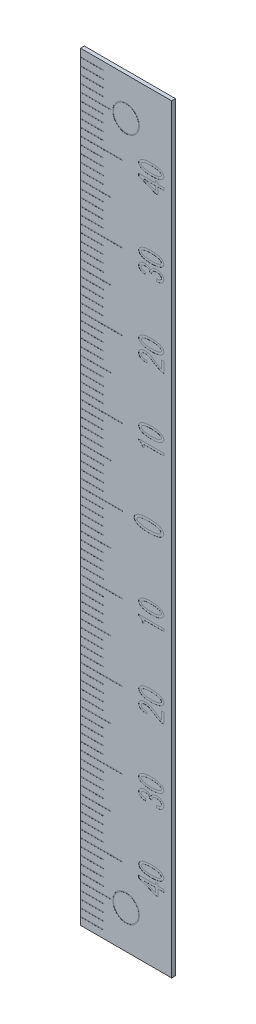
from build123d import *

# Parameters (mm, degrees)
SKETCH1_W      = 12
SKETCH1_H      = 100
EXTRUDE1_DEPTH = 0.5
SKETCH2_R      = 1.75
SKETCH2_R_2    = 1.65
EXTRUDE2_DEPTH = 0.01
EXTRUDE3_DEPTH = 0.01
SKETCH4_W      = 3
SKETCH4_H      = 0.1
SKETCH4_W_2    = 4
SKETCH4_W_3    = 5.5
EXTRUDE4_DEPTH = 0.01


with BuildPart() as part:
    # Sketch1 → Extrude1 (new body)
    with BuildSketch(Plane.XY):
        with Locations((6, 50)):
            Rectangle(SKETCH1_W, SKETCH1_H)
    extrude(amount=EXTRUDE1_DEPTH)

    # Sketch2 → Extrude2 (cut)
    # profile 1 of 2: a face of its own
    with BuildSketch(Plane.XY.offset(0.5)):
        with Locations((6, 5)):
            Circle(SKETCH2_R)
        with Locations((6, 5)):
            Circle(SKETCH2_R_2, mode=Mode.SUBTRACT)
    # profile 2 of 2: a face of its own
    with BuildSketch(Plane.XY.offset(0.5)):
        with Locations((6, 95)):
            Circle(SKETCH2_R)
        with Locations((6, 95)):
            Circle(SKETCH2_R_2, mode=Mode.SUBTRACT)
    extrude(amount=-EXTRUDE2_DEPTH, mode=Mode.SUBTRACT)

    # Sketch3 → Extrude3 (cut)
    # profile 1 of 17: a face of its own
    with BuildSketch(Plane.XY.offset(0.5)):
        Polygon((10.964202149, 89.253595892), (10.576078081, 89.253595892), (10.18481385, 89.253595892), (10.18481385, 88.358021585), (9.863889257, 88.358021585), (7.659495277, 89.263016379), (7.659495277, 89.57326442), (9.863889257, 89.57326442), (9.863889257, 89.857135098), (10.18481385, 89.857135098), (10.18481385, 89.57326442), (10.964202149, 89.57326442), align=None)
        Polygon((9.863889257, 89.253595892), (8.371684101, 89.253595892), (9.863889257, 88.655080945), align=None, mode=Mode.SUBTRACT)
    # profile 2 of 17: a face of its own
    with BuildSketch(Plane.XY.offset(0.5)):
        with BuildLine():
            add(Edge.make_bspline(
                [(9.304312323, 90.08636695), (9.263487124, 90.086598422), (9.183284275, 90.087053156), (9.065184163, 90.090916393), (8.951677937, 90.097059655), (8.842790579, 90.105920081), (8.738418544, 90.116877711), (8.638826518, 90.131643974), (8.543659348, 90.147711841), (8.453367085, 90.166540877), (8.367534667, 90.187646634), (8.286660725, 90.212475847), (8.209981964, 90.238496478), (8.13792646, 90.267351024), (8.071052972, 90.299483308), (8.008231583, 90.333293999), (7.950513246, 90.370357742), (7.914537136, 90.397244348), (7.896891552, 90.410431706)],
                knots=[0, 0, 0, 0, 1.334199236, 2.621091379, 3.861325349, 5.048806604, 6.191184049, 7.29033474, 8.338632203, 9.344988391, 10.304094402, 11.226124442, 12.10888774, 12.949942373, 13.760906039, 14.53244093, 15.280190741, 16, 16, 16, 16], degree=3))
            add(Edge.make_bspline(
                [(7.896891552, 90.410431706), (7.877886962, 90.425936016), (7.841081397, 90.455962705), (7.793642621, 90.506288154), (7.75209867, 90.556343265), (7.718531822, 90.608467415), (7.691781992, 90.661574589), (7.673561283, 90.716630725), (7.661657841, 90.77250316), (7.660214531, 90.810429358), (7.659495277, 90.829329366)],
                knots=[0, 0, 0, 0, 1.179273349, 2.283859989, 3.322502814, 4.306324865, 5.261663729, 6.17616916, 7.091118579, 8, 8, 8, 8], degree=3))
            add(Edge.make_bspline(
                [(7.659495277, 90.829329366), (7.660212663, 90.848230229), (7.661652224, 90.886158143), (7.67358392, 90.942017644), (7.691636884, 90.996945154), (7.718688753, 91.049705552), (7.752296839, 91.101723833), (7.793217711, 91.152330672), (7.841340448, 91.202029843), (7.877935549, 91.232049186), (7.896891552, 91.247598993)],
                knots=[0, 0, 0, 0, 0.909839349, 1.825753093, 2.741222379, 3.688535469, 4.673394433, 5.720979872, 6.819483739, 8, 8, 8, 8], degree=3))
            add(Edge.make_bspline(
                [(7.896891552, 91.247598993), (7.914537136, 91.260786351), (7.950513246, 91.287672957), (8.008231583, 91.3247367), (8.071052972, 91.358547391), (8.13792646, 91.390679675), (8.209981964, 91.419534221), (8.286660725, 91.445554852), (8.367534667, 91.470384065), (8.453367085, 91.491489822), (8.543659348, 91.510318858), (8.638826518, 91.526386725), (8.738418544, 91.541152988), (8.842790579, 91.552110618), (8.951677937, 91.560971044), (9.065184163, 91.567114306), (9.183284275, 91.570977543), (9.263487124, 91.571432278), (9.304312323, 91.571663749)],
                knots=[0, 0, 0, 0, 0.719809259, 1.46755907, 2.239093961, 3.050057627, 3.89111226, 4.773875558, 5.695905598, 6.655011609, 7.661367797, 8.70966526, 9.808815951, 10.951193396, 12.138674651, 13.378908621, 14.665800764, 16, 16, 16, 16], degree=3))
            add(Edge.make_bspline(
                [(9.304312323, 91.571663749), (9.345974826, 91.571432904), (9.427642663, 91.570980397), (9.547627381, 91.567132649), (9.662805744, 91.560946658), (9.773365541, 91.552091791), (9.879218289, 91.541255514), (9.980042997, 91.52631378), (10.076267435, 91.510328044), (10.167806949, 91.49146689), (10.25471717, 91.470480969), (10.336402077, 91.445542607), (10.413707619, 91.419531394), (10.486394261, 91.390685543), (10.553875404, 91.358519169), (10.617234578, 91.324907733), (10.675058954, 91.28765614), (10.711041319, 91.260780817), (10.728689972, 91.247598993)],
                knots=[0, 0, 0, 0, 1.346341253, 2.639130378, 3.8790076, 5.073442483, 6.223226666, 7.316783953, 8.366697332, 9.375051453, 10.336565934, 11.254764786, 12.134057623, 12.971986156, 13.779994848, 14.548849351, 15.288238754, 16, 16, 16, 16], degree=3))
            add(Edge.make_bspline(
                [(10.728689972, 91.247598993), (10.747351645, 91.231964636), (10.783604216, 91.201592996), (10.832476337, 91.152791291), (10.872490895, 91.101447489), (10.906527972, 91.049937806), (10.932289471, 90.996615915), (10.951811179, 90.942259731), (10.962410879, 90.886054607), (10.964024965, 90.848209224), (10.964830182, 90.829329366)],
                knots=[0, 0, 0, 0, 1.1743338, 2.28128622, 3.323893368, 4.309986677, 5.254013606, 6.173907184, 7.08902033, 8, 8, 8, 8], degree=3))
            add(Edge.make_bspline(
                [(10.964830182, 90.829329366), (10.964023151, 90.81045032), (10.962405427, 90.772606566), (10.95183315, 90.716389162), (10.932141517, 90.661902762), (10.906685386, 90.608236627), (10.872691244, 90.556620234), (10.832051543, 90.505827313), (10.783860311, 90.456400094), (10.747399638, 90.426020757), (10.728689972, 90.410431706)],
                knots=[0, 0, 0, 0, 0.910025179, 1.824179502, 2.743109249, 3.69522398, 4.680284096, 5.713901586, 6.826896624, 8, 8, 8, 8], degree=3))
            add(Edge.make_bspline(
                [(10.728689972, 90.410431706), (10.711041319, 90.397249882), (10.675058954, 90.370374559), (10.617234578, 90.333122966), (10.553875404, 90.29951153), (10.486394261, 90.267345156), (10.413707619, 90.238499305), (10.336402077, 90.212488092), (10.25471717, 90.18754973), (10.167806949, 90.166563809), (10.076267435, 90.147702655), (9.980042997, 90.131716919), (9.879218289, 90.116775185), (9.773365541, 90.105938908), (9.662805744, 90.097084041), (9.547627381, 90.09089805), (9.427642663, 90.087050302), (9.345974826, 90.086597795), (9.304312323, 90.08636695)],
                knots=[0, 0, 0, 0, 0.711761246, 1.451150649, 2.220005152, 3.028013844, 3.865942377, 4.745235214, 5.663434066, 6.624948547, 7.633302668, 8.683216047, 9.776773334, 10.926557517, 12.1209924, 13.360869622, 14.653658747, 16, 16, 16, 16], degree=3))
        make_face()
        with BuildLine():
            add(Edge.make_bspline(
                [(9.304312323, 91.261415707), (9.267676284, 91.261069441), (9.195861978, 91.260390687), (9.090316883, 91.258165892), (8.989150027, 91.253278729), (8.892481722, 91.245290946), (8.80022693, 91.237179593), (8.712814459, 91.225295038), (8.629718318, 91.213328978), (8.551258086, 91.197943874), (8.47692929, 91.181420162), (8.407398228, 91.16150603), (8.341873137, 91.141413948), (8.281453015, 91.117852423), (8.225379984, 91.092883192), (8.173815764, 91.065786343), (8.126168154, 91.037204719), (8.097468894, 91.015283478), (8.083417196, 91.004550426)],
                knots=[0, 0, 0, 0, 1.387476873, 2.71974516, 3.997715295, 5.222316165, 6.392993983, 7.5041764, 8.562605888, 9.571696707, 10.531368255, 11.445041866, 12.310057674, 13.125709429, 13.899281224, 14.633331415, 15.330853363, 16, 16, 16, 16], degree=3))
            add(Edge.make_bspline(
                [(8.083417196, 91.004550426), (8.067942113, 90.991309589), (8.038992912, 90.966539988), (8.006840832, 90.922559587), (7.985224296, 90.87705391), (7.982844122, 90.845041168), (7.981675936, 90.829329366)],
                knots=[0, 0, 0, 0, 1.162721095, 2.175099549, 3.10434177, 4, 4, 4, 4], degree=3))
            add(Edge.make_bspline(
                [(7.981675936, 90.829329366), (7.982836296, 90.813611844), (7.985200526, 90.781587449), (8.007018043, 90.736019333), (8.038753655, 90.691521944), (8.067903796, 90.666693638), (8.083417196, 90.653480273)],
                knots=[0, 0, 0, 0, 0.893494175, 1.820491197, 2.840088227, 4, 4, 4, 4], degree=3))
            add(Edge.make_bspline(
                [(8.083417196, 90.653480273), (8.098156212, 90.643035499), (8.128454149, 90.621564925), (8.177291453, 90.592299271), (8.230299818, 90.565060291), (8.287887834, 90.540907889), (8.349363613, 90.517529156), (8.415145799, 90.496237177), (8.485227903, 90.477516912), (8.559390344, 90.460570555), (8.637959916, 90.445608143), (8.720652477, 90.432335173), (8.807623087, 90.421817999), (8.898748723, 90.413272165), (8.994176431, 90.405404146), (9.093874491, 90.400498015), (9.197746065, 90.398267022), (9.268304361, 90.397589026), (9.304312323, 90.397243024)],
                knots=[0, 0, 0, 0, 0.684573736, 1.407229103, 2.156074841, 2.941731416, 3.772993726, 4.648817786, 5.561264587, 6.521855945, 7.531913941, 8.592575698, 9.69595549, 10.851956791, 12.06190895, 13.325252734, 14.634998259, 16, 16, 16, 16], degree=3))
            add(Edge.make_bspline(
                [(9.304312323, 90.397243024), (9.341785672, 90.397588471), (9.415065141, 90.398263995), (9.522703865, 90.400490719), (9.625541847, 90.405385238), (9.723691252, 90.413273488), (9.817323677, 90.421841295), (9.906404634, 90.432229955), (9.990753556, 90.445635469), (10.070391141, 90.460491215), (10.145369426, 90.477539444), (10.215901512, 90.496147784), (10.281702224, 90.517419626), (10.342729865, 90.540898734), (10.399661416, 90.565104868), (10.451853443, 90.591966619), (10.49904188, 90.621590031), (10.528053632, 90.643045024), (10.542164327, 90.653480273)],
                knots=[0, 0, 0, 0, 1.401046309, 2.739758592, 4.0248449, 5.249399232, 6.420696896, 7.540008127, 8.601571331, 9.613140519, 10.568176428, 11.475655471, 12.339456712, 13.151990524, 13.919674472, 14.651282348, 15.344012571, 16, 16, 16, 16], degree=3))
            add(Edge.make_bspline(
                [(10.542164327, 90.653480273), (10.557596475, 90.666746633), (10.586687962, 90.691755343), (10.619429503, 90.735654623), (10.640196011, 90.781762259), (10.642682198, 90.813642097), (10.643905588, 90.829329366)],
                knots=[0, 0, 0, 0, 1.159232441, 2.18529495, 3.107029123, 4, 4, 4, 4], degree=3))
            add(Edge.make_bspline(
                [(10.643905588, 90.829329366), (10.642674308, 90.845010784), (10.640172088, 90.876878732), (10.619603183, 90.922925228), (10.586449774, 90.966304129), (10.557558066, 90.991255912), (10.542164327, 91.004550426)],
                knots=[0, 0, 0, 0, 0.89511734, 1.819067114, 2.837981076, 4, 4, 4, 4], degree=3))
            add(Edge.make_bspline(
                [(10.542164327, 91.004550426), (10.528109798, 91.015278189), (10.499404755, 91.037188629), (10.45164342, 91.065951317), (10.399548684, 91.092855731), (10.342868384, 91.117856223), (10.281814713, 91.14140776), (10.215668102, 91.161504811), (10.14550559, 91.181409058), (10.070358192, 91.198018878), (9.990830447, 91.213306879), (9.906283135, 91.225349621), (9.817389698, 91.237124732), (9.72367965, 91.245296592), (9.625545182, 91.253298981), (9.522702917, 91.258160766), (9.415065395, 91.26039668), (9.341785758, 91.261070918), (9.304312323, 91.261415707)],
                knots=[0, 0, 0, 0, 0.660466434, 1.348940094, 2.080407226, 2.851088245, 3.663465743, 4.524722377, 5.434082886, 6.388935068, 7.400309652, 8.46048529, 9.580538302, 10.751610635, 11.975929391, 13.260768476, 14.599223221, 16, 16, 16, 16], degree=3))
        make_face(mode=Mode.SUBTRACT)
    # profile 3 of 17: a face of its own
    with BuildSketch(Plane.XY.offset(0.5)):
        with BuildLine():
            add(Edge.make_bspline(
                [(9.982587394, 78.709091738), (10.012525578, 78.708287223), (10.070543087, 78.706728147), (10.154420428, 78.710760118), (10.232130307, 78.718455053), (10.303298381, 78.73168567), (10.368273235, 78.749141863), (10.427053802, 78.770782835), (10.479378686, 78.79791141), (10.510164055, 78.820091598), (10.525207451, 78.830930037)],
                knots=[0, 0, 0, 0, 1.267087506, 2.455501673, 3.55133733, 4.569646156, 5.515332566, 6.395721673, 7.21606285, 8, 8, 8, 8], degree=3))
            add(Edge.make_bspline(
                [(10.525207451, 78.830930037), (10.543506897, 78.847280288), (10.579345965, 78.8793019), (10.617183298, 78.941459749), (10.639871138, 79.011713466), (10.642530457, 79.061449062), (10.643905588, 79.087167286)],
                knots=[0, 0, 0, 0, 1.002413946, 1.963205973, 2.946775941, 4, 4, 4, 4], degree=3))
            add(Edge.make_bspline(
                [(10.643905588, 79.087167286), (10.64205895, 79.10966892), (10.638250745, 79.15607263), (10.60631016, 79.222801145), (10.557507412, 79.287350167), (10.514319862, 79.324320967), (10.491293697, 79.344032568)],
                knots=[0, 0, 0, 0, 0.87119639, 1.796613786, 2.82522778, 4, 4, 4, 4], degree=3))
            add(Edge.make_bspline(
                [(10.491293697, 79.344032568), (10.477715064, 79.35383947), (10.449615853, 79.374133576), (10.40102721, 79.398039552), (10.347048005, 79.41973801), (10.286272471, 79.436247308), (10.219328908, 79.449449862), (10.146079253, 79.458528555), (10.066417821, 79.464292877), (10.011278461, 79.464917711), (9.982587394, 79.465242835)],
                knots=[0, 0, 0, 0, 0.754595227, 1.561536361, 2.43511806, 3.377163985, 4.397951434, 5.512234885, 6.705522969, 8, 8, 8, 8], degree=3))
            add(Edge.make_bspline(
                [(9.982587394, 79.465242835), (9.960377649, 79.46473344), (9.916687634, 79.463731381), (9.85267071, 79.456647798), (9.791236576, 79.44559945), (9.732735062, 79.428991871), (9.676430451, 79.40846888), (9.623062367, 79.382368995), (9.571883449, 79.352579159), (9.540443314, 79.328863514), (9.524751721, 79.317027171)],
                knots=[0, 0, 0, 0, 1.086352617, 2.137024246, 3.147391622, 4.136355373, 5.10847195, 6.074961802, 7.039224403, 8, 8, 8, 8], degree=3))
            add(Edge.make_bspline(
                [(9.524751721, 79.317027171), (9.514022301, 79.307663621), (9.492758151, 79.289106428), (9.465670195, 79.256771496), (9.44319759, 79.221167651), (9.426529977, 79.181802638), (9.413593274, 79.139332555), (9.406578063, 79.093273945), (9.403067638, 79.044064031), (9.405038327, 79.010337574), (9.406053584, 78.992962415)],
                knots=[0, 0, 0, 0, 0.947861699, 1.87852391, 2.799832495, 3.743268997, 4.71875736, 5.750864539, 6.841292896, 8, 8, 8, 8], degree=3))
            Line((9.406053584, 78.992962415), (9.117786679, 78.992962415))
            add(Edge.make_bspline(
                [(9.117786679, 78.992962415), (9.115917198, 79.01036469), (9.11227151, 79.044300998), (9.103170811, 79.09366086), (9.089082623, 79.139312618), (9.072365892, 79.182135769), (9.050836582, 79.220887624), (9.026138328, 79.256550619), (8.997813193, 79.288974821), (8.976089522, 79.307646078), (8.965174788, 79.317027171)],
                knots=[0, 0, 0, 0, 1.139052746, 2.221275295, 3.260086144, 4.244297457, 5.207730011, 6.137529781, 7.064229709, 8, 8, 8, 8], degree=3))
            add(Edge.make_bspline(
                [(8.965174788, 79.317027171), (8.953430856, 79.325692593), (8.929384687, 79.343435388), (8.888683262, 79.365118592), (8.844024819, 79.38418922), (8.794826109, 79.398815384), (8.741812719, 79.411043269), (8.684417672, 79.41879032), (8.62278159, 79.423939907), (8.580202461, 79.42467109), (8.558209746, 79.425048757)],
                knots=[0, 0, 0, 0, 0.816014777, 1.670822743, 2.574059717, 3.530392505, 4.539613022, 5.616822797, 6.769055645, 8, 8, 8, 8], degree=3))
            add(Edge.make_bspline(
                [(8.558209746, 79.425048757), (8.530985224, 79.424710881), (8.478357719, 79.424057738), (8.402231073, 79.418395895), (8.331762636, 79.409047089), (8.266898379, 79.396390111), (8.208285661, 79.3784051), (8.154956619, 79.358063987), (8.10766056, 79.33316966), (8.079858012, 79.312952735), (8.06646032, 79.303210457)],
                knots=[0, 0, 0, 0, 1.267211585, 2.44963652, 3.550842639, 4.575246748, 5.5217347, 6.401234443, 7.229575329, 8, 8, 8, 8], degree=3))
            add(Edge.make_bspline(
                [(8.06646032, 79.303210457), (8.050800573, 79.289680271), (8.020516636, 79.263514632), (7.989112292, 79.21338768), (7.967772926, 79.159180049), (7.965751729, 79.120663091), (7.964719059, 79.100984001)],
                knots=[0, 0, 0, 0, 1.053722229, 2.037763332, 2.997453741, 4, 4, 4, 4], degree=3))
            add(Edge.make_bspline(
                [(7.964719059, 79.100984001), (7.965793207, 79.081323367), (7.967906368, 79.0426452), (7.988749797, 78.988170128), (8.020925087, 78.938367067), (8.050860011, 78.911914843), (8.06646032, 78.898129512)],
                knots=[0, 0, 0, 0, 1.000412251, 1.968100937, 2.94109465, 4, 4, 4, 4], degree=3))
            add(Edge.make_bspline(
                [(8.06646032, 78.898129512), (8.081277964, 78.887055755), (8.111428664, 78.864523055), (8.162612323, 78.837488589), (8.218046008, 78.812216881), (8.279698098, 78.793150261), (8.345928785, 78.775455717), (8.417710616, 78.763754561), (8.494531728, 78.75366975), (8.547707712, 78.75119286), (8.575166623, 78.749913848)],
                knots=[0, 0, 0, 0, 0.823448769, 1.675540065, 2.573857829, 3.535986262, 4.547798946, 5.627975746, 6.775138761, 8, 8, 8, 8], degree=3))
            Line((8.575166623, 78.749913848), (8.575166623, 78.452854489))
            add(Edge.make_bspline(
                [(8.575166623, 78.452854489), (8.539320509, 78.454383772), (8.469081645, 78.457380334), (8.36662153, 78.471341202), (8.269148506, 78.489228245), (8.177509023, 78.515831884), (8.090488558, 78.54647123), (8.009243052, 78.585395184), (7.932662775, 78.629471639), (7.886090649, 78.664635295), (7.862977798, 78.682086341)],
                knots=[0, 0, 0, 0, 1.130465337, 2.215096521, 3.257023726, 4.251490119, 5.220175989, 6.161913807, 7.087793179, 8, 8, 8, 8], degree=3))
            add(Edge.make_bspline(
                [(7.862977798, 78.682086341), (7.8467956, 78.695809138), (7.81513049, 78.722661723), (7.772968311, 78.767477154), (7.738724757, 78.816404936), (7.709237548, 78.867139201), (7.68725208, 78.92158891), (7.670766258, 78.978543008), (7.661240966, 79.038909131), (7.660084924, 79.080016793), (7.659495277, 79.100984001)],
                knots=[0, 0, 0, 0, 1.054146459, 2.062739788, 3.04727221, 4.0164563, 4.972878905, 5.957576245, 6.958249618, 8, 8, 8, 8], degree=3))
            add(Edge.make_bspline(
                [(7.659495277, 79.100984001), (7.660084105, 79.122995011), (7.661233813, 79.165972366), (7.67065538, 79.228867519), (7.687412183, 79.288028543), (7.708926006, 79.344536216), (7.738532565, 79.396768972), (7.773183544, 79.446397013), (7.814699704, 79.492477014), (7.846729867, 79.519408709), (7.862977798, 79.533070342)],
                knots=[0, 0, 0, 0, 1.066551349, 2.082482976, 3.072030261, 4.042353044, 5.005167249, 5.973525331, 6.972030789, 8, 8, 8, 8], degree=3))
            add(Edge.make_bspline(
                [(7.862977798, 79.533070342), (7.883180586, 79.548391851), (7.923800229, 79.579197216), (7.99101211, 79.617407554), (8.063031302, 79.649133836), (8.139054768, 79.676462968), (8.220201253, 79.697274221), (8.306188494, 79.711237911), (8.396823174, 79.720285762), (8.458748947, 79.721491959), (8.490382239, 79.722108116)],
                knots=[0, 0, 0, 0, 0.910342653, 1.830331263, 2.769796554, 3.735781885, 4.730142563, 5.775142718, 6.863485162, 8, 8, 8, 8], degree=3))
            add(Edge.make_bspline(
                [(8.490382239, 79.722108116), (8.519286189, 79.72161156), (8.575295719, 79.720649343), (8.656472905, 79.713669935), (8.732474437, 79.70249683), (8.803229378, 79.686672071), (8.868446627, 79.664650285), (8.928974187, 79.640082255), (8.984286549, 79.610093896), (9.016949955, 79.585400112), (9.033002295, 79.57326442)],
                knots=[0, 0, 0, 0, 1.210143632, 2.344993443, 3.40861805, 4.424997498, 5.37575867, 6.287368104, 7.158331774, 8, 8, 8, 8], degree=3))
            add(Edge.make_bspline(
                [(9.033002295, 79.57326442), (9.059175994, 79.551536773), (9.108490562, 79.51059913), (9.171793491, 79.445781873), (9.221317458, 79.38266922), (9.243208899, 79.337936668), (9.253441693, 79.317027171)],
                knots=[0, 0, 0, 0, 1.195517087, 2.252505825, 3.183162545, 4, 4, 4, 4], degree=3))
            add(Edge.make_bspline(
                [(9.253441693, 79.317027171), (9.265088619, 79.34500906), (9.287538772, 79.398945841), (9.331763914, 79.47199791), (9.381380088, 79.535717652), (9.420772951, 79.570253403), (9.439967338, 79.587081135)],
                knots=[0, 0, 0, 0, 1.094399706, 2.109521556, 3.078854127, 4, 4, 4, 4], degree=3))
            add(Edge.make_bspline(
                [(9.439967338, 79.587081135), (9.459994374, 79.60234586), (9.499821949, 79.632702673), (9.564355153, 79.670989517), (9.632227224, 79.703077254), (9.702874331, 79.730156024), (9.776856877, 79.751027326), (9.854027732, 79.765256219), (9.934226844, 79.774233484), (9.988843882, 79.775485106), (10.016501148, 79.776118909)],
                knots=[0, 0, 0, 0, 0.976244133, 1.941447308, 2.904084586, 3.885987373, 4.873249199, 5.881498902, 6.927222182, 8, 8, 8, 8], degree=3))
            add(Edge.make_bspline(
                [(10.016501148, 79.776118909), (10.052324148, 79.77559206), (10.122443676, 79.774560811), (10.225084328, 79.764261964), (10.322576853, 79.747624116), (10.414506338, 79.72361205), (10.501245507, 79.69357359), (10.582537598, 79.656250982), (10.659144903, 79.612707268), (10.705595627, 79.577553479), (10.728689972, 79.560075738)],
                knots=[0, 0, 0, 0, 1.13285732, 2.217441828, 3.259318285, 4.258350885, 5.219645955, 6.158999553, 7.084692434, 8, 8, 8, 8], degree=3))
            add(Edge.make_bspline(
                [(10.728689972, 79.560075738), (10.747408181, 79.544073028), (10.784031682, 79.512762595), (10.832853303, 79.461250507), (10.873280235, 79.40591535), (10.906871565, 79.348128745), (10.932721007, 79.287091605), (10.951971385, 79.223397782), (10.962541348, 79.156184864), (10.964058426, 79.110438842), (10.964830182, 79.087167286)],
                knots=[0, 0, 0, 0, 1.078182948, 2.109541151, 3.099814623, 4.073306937, 5.030426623, 5.996463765, 6.980776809, 8, 8, 8, 8], degree=3))
            add(Edge.make_bspline(
                [(10.964830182, 79.087167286), (10.964367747, 79.062001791), (10.963461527, 79.012685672), (10.952274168, 78.941195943), (10.935512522, 78.873719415), (10.911441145, 78.810497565), (10.88066456, 78.751121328), (10.842591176, 78.696168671), (10.797876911, 78.645289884), (10.763207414, 78.615937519), (10.745646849, 78.601070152)],
                knots=[0, 0, 0, 0, 1.091653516, 2.139282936, 3.133504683, 4.105839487, 5.069340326, 6.029921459, 7.002128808, 8, 8, 8, 8], degree=3))
            add(Edge.make_bspline(
                [(10.745646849, 78.601070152), (10.723356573, 78.584883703), (10.677849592, 78.551838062), (10.601818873, 78.510403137), (10.51783525, 78.476087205), (10.426096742, 78.448030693), (10.326687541, 78.425207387), (10.21890008, 78.410072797), (10.103344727, 78.400491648), (10.023639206, 78.399403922), (9.982587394, 78.398843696)],
                knots=[0, 0, 0, 0, 0.821972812, 1.678108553, 2.577822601, 3.526913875, 4.539938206, 5.620279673, 6.774340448, 8, 8, 8, 8], degree=3))
            Line((9.982587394, 78.398843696), (9.982587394, 78.709091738))
        make_face()
    # profile 4 of 17: a face of its own
    with BuildSketch(Plane.XY.offset(0.5)):
        with BuildLine():
            add(Edge.make_bspline(
                [(9.304312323, 80.08636695), (9.263487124, 80.086598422), (9.183284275, 80.087053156), (9.065184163, 80.090916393), (8.951677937, 80.097059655), (8.842790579, 80.105920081), (8.738418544, 80.116877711), (8.638826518, 80.131643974), (8.543659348, 80.147711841), (8.453367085, 80.166540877), (8.367534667, 80.187646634), (8.286660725, 80.212475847), (8.209981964, 80.238496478), (8.13792646, 80.267351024), (8.071052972, 80.299483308), (8.008231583, 80.333293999), (7.950513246, 80.370357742), (7.914537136, 80.397244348), (7.896891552, 80.410431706)],
                knots=[0, 0, 0, 0, 1.334199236, 2.621091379, 3.861325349, 5.048806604, 6.191184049, 7.29033474, 8.338632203, 9.344988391, 10.304094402, 11.226124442, 12.10888774, 12.949942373, 13.760906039, 14.53244093, 15.280190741, 16, 16, 16, 16], degree=3))
            add(Edge.make_bspline(
                [(7.896891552, 80.410431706), (7.877886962, 80.425936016), (7.841081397, 80.455962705), (7.793642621, 80.506288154), (7.75209867, 80.556343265), (7.718531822, 80.608467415), (7.691781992, 80.661574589), (7.673561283, 80.716630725), (7.661657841, 80.77250316), (7.660214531, 80.810429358), (7.659495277, 80.829329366)],
                knots=[0, 0, 0, 0, 1.179273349, 2.283859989, 3.322502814, 4.306324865, 5.261663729, 6.17616916, 7.091118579, 8, 8, 8, 8], degree=3))
            add(Edge.make_bspline(
                [(7.659495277, 80.829329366), (7.660212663, 80.848230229), (7.661652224, 80.886158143), (7.67358392, 80.942017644), (7.691636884, 80.996945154), (7.718688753, 81.049705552), (7.752296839, 81.101723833), (7.793217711, 81.152330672), (7.841340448, 81.202029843), (7.877935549, 81.232049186), (7.896891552, 81.247598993)],
                knots=[0, 0, 0, 0, 0.909839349, 1.825753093, 2.741222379, 3.688535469, 4.673394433, 5.720979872, 6.819483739, 8, 8, 8, 8], degree=3))
            add(Edge.make_bspline(
                [(7.896891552, 81.247598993), (7.914537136, 81.260786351), (7.950513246, 81.287672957), (8.008231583, 81.3247367), (8.071052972, 81.358547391), (8.13792646, 81.390679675), (8.209981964, 81.419534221), (8.286660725, 81.445554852), (8.367534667, 81.470384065), (8.453367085, 81.491489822), (8.543659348, 81.510318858), (8.638826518, 81.526386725), (8.738418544, 81.541152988), (8.842790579, 81.552110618), (8.951677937, 81.560971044), (9.065184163, 81.567114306), (9.183284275, 81.570977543), (9.263487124, 81.571432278), (9.304312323, 81.571663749)],
                knots=[0, 0, 0, 0, 0.719809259, 1.46755907, 2.239093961, 3.050057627, 3.89111226, 4.773875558, 5.695905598, 6.655011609, 7.661367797, 8.70966526, 9.808815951, 10.951193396, 12.138674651, 13.378908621, 14.665800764, 16, 16, 16, 16], degree=3))
            add(Edge.make_bspline(
                [(9.304312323, 81.571663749), (9.345974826, 81.571432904), (9.427642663, 81.570980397), (9.547627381, 81.567132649), (9.662805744, 81.560946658), (9.773365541, 81.552091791), (9.879218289, 81.541255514), (9.980042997, 81.52631378), (10.076267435, 81.510328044), (10.167806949, 81.49146689), (10.25471717, 81.470480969), (10.336402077, 81.445542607), (10.413707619, 81.419531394), (10.486394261, 81.390685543), (10.553875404, 81.358519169), (10.617234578, 81.324907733), (10.675058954, 81.28765614), (10.711041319, 81.260780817), (10.728689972, 81.247598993)],
                knots=[0, 0, 0, 0, 1.346341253, 2.639130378, 3.8790076, 5.073442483, 6.223226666, 7.316783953, 8.366697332, 9.375051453, 10.336565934, 11.254764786, 12.134057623, 12.971986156, 13.779994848, 14.548849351, 15.288238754, 16, 16, 16, 16], degree=3))
            add(Edge.make_bspline(
                [(10.728689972, 81.247598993), (10.747351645, 81.231964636), (10.783604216, 81.201592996), (10.832476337, 81.152791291), (10.872490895, 81.101447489), (10.906527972, 81.049937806), (10.932289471, 80.996615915), (10.951811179, 80.942259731), (10.962410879, 80.886054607), (10.964024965, 80.848209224), (10.964830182, 80.829329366)],
                knots=[0, 0, 0, 0, 1.1743338, 2.28128622, 3.323893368, 4.309986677, 5.254013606, 6.173907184, 7.08902033, 8, 8, 8, 8], degree=3))
            add(Edge.make_bspline(
                [(10.964830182, 80.829329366), (10.964023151, 80.81045032), (10.962405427, 80.772606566), (10.95183315, 80.716389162), (10.932141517, 80.661902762), (10.906685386, 80.608236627), (10.872691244, 80.556620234), (10.832051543, 80.505827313), (10.783860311, 80.456400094), (10.747399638, 80.426020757), (10.728689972, 80.410431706)],
                knots=[0, 0, 0, 0, 0.910025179, 1.824179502, 2.743109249, 3.69522398, 4.680284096, 5.713901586, 6.826896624, 8, 8, 8, 8], degree=3))
            add(Edge.make_bspline(
                [(10.728689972, 80.410431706), (10.711041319, 80.397249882), (10.675058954, 80.370374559), (10.617234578, 80.333122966), (10.553875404, 80.29951153), (10.486394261, 80.267345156), (10.413707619, 80.238499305), (10.336402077, 80.212488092), (10.25471717, 80.18754973), (10.167806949, 80.166563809), (10.076267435, 80.147702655), (9.980042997, 80.131716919), (9.879218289, 80.116775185), (9.773365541, 80.105938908), (9.662805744, 80.097084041), (9.547627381, 80.09089805), (9.427642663, 80.087050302), (9.345974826, 80.086597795), (9.304312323, 80.08636695)],
                knots=[0, 0, 0, 0, 0.711761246, 1.451150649, 2.220005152, 3.028013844, 3.865942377, 4.745235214, 5.663434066, 6.624948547, 7.633302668, 8.683216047, 9.776773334, 10.926557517, 12.1209924, 13.360869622, 14.653658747, 16, 16, 16, 16], degree=3))
        make_face()
        with BuildLine():
            add(Edge.make_bspline(
                [(9.304312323, 81.261415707), (9.267676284, 81.261069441), (9.195861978, 81.260390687), (9.090316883, 81.258165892), (8.989150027, 81.253278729), (8.892481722, 81.245290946), (8.80022693, 81.237179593), (8.712814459, 81.225295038), (8.629718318, 81.213328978), (8.551258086, 81.197943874), (8.47692929, 81.181420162), (8.407398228, 81.16150603), (8.341873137, 81.141413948), (8.281453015, 81.117852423), (8.225379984, 81.092883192), (8.173815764, 81.065786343), (8.126168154, 81.037204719), (8.097468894, 81.015283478), (8.083417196, 81.004550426)],
                knots=[0, 0, 0, 0, 1.387476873, 2.71974516, 3.997715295, 5.222316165, 6.392993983, 7.5041764, 8.562605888, 9.571696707, 10.531368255, 11.445041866, 12.310057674, 13.125709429, 13.899281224, 14.633331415, 15.330853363, 16, 16, 16, 16], degree=3))
            add(Edge.make_bspline(
                [(8.083417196, 81.004550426), (8.067942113, 80.991309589), (8.038992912, 80.966539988), (8.006840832, 80.922559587), (7.985224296, 80.87705391), (7.982844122, 80.845041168), (7.981675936, 80.829329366)],
                knots=[0, 0, 0, 0, 1.162721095, 2.175099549, 3.10434177, 4, 4, 4, 4], degree=3))
            add(Edge.make_bspline(
                [(7.981675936, 80.829329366), (7.982836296, 80.813611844), (7.985200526, 80.781587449), (8.007018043, 80.736019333), (8.038753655, 80.691521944), (8.067903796, 80.666693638), (8.083417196, 80.653480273)],
                knots=[0, 0, 0, 0, 0.893494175, 1.820491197, 2.840088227, 4, 4, 4, 4], degree=3))
            add(Edge.make_bspline(
                [(8.083417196, 80.653480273), (8.098156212, 80.643035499), (8.128454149, 80.621564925), (8.177291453, 80.592299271), (8.230299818, 80.565060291), (8.287887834, 80.540907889), (8.349363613, 80.517529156), (8.415145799, 80.496237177), (8.485227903, 80.477516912), (8.559390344, 80.460570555), (8.637959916, 80.445608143), (8.720652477, 80.432335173), (8.807623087, 80.421817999), (8.898748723, 80.413272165), (8.994176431, 80.405404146), (9.093874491, 80.400498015), (9.197746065, 80.398267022), (9.268304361, 80.397589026), (9.304312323, 80.397243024)],
                knots=[0, 0, 0, 0, 0.684573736, 1.407229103, 2.156074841, 2.941731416, 3.772993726, 4.648817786, 5.561264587, 6.521855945, 7.531913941, 8.592575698, 9.69595549, 10.851956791, 12.06190895, 13.325252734, 14.634998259, 16, 16, 16, 16], degree=3))
            add(Edge.make_bspline(
                [(9.304312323, 80.397243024), (9.341785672, 80.397588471), (9.415065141, 80.398263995), (9.522703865, 80.400490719), (9.625541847, 80.405385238), (9.723691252, 80.413273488), (9.817323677, 80.421841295), (9.906404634, 80.432229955), (9.990753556, 80.445635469), (10.070391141, 80.460491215), (10.145369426, 80.477539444), (10.215901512, 80.496147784), (10.281702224, 80.517419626), (10.342729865, 80.540898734), (10.399661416, 80.565104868), (10.451853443, 80.591966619), (10.49904188, 80.621590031), (10.528053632, 80.643045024), (10.542164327, 80.653480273)],
                knots=[0, 0, 0, 0, 1.401046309, 2.739758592, 4.0248449, 5.249399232, 6.420696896, 7.540008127, 8.601571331, 9.613140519, 10.568176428, 11.475655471, 12.339456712, 13.151990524, 13.919674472, 14.651282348, 15.344012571, 16, 16, 16, 16], degree=3))
            add(Edge.make_bspline(
                [(10.542164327, 80.653480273), (10.557596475, 80.666746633), (10.586687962, 80.691755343), (10.619429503, 80.735654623), (10.640196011, 80.781762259), (10.642682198, 80.813642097), (10.643905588, 80.829329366)],
                knots=[0, 0, 0, 0, 1.159232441, 2.18529495, 3.107029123, 4, 4, 4, 4], degree=3))
            add(Edge.make_bspline(
                [(10.643905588, 80.829329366), (10.642674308, 80.845010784), (10.640172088, 80.876878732), (10.619603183, 80.922925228), (10.586449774, 80.966304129), (10.557558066, 80.991255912), (10.542164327, 81.004550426)],
                knots=[0, 0, 0, 0, 0.89511734, 1.819067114, 2.837981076, 4, 4, 4, 4], degree=3))
            add(Edge.make_bspline(
                [(10.542164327, 81.004550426), (10.528109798, 81.015278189), (10.499404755, 81.037188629), (10.45164342, 81.065951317), (10.399548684, 81.092855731), (10.342868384, 81.117856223), (10.281814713, 81.14140776), (10.215668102, 81.161504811), (10.14550559, 81.181409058), (10.070358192, 81.198018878), (9.990830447, 81.213306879), (9.906283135, 81.225349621), (9.817389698, 81.237124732), (9.72367965, 81.245296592), (9.625545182, 81.253298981), (9.522702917, 81.258160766), (9.415065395, 81.26039668), (9.341785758, 81.261070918), (9.304312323, 81.261415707)],
                knots=[0, 0, 0, 0, 0.660466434, 1.348940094, 2.080407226, 2.851088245, 3.663465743, 4.524722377, 5.434082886, 6.388935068, 7.400309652, 8.46048529, 9.580538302, 10.751610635, 11.975929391, 13.260768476, 14.599223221, 16, 16, 16, 16], degree=3))
        make_face(mode=Mode.SUBTRACT)
    # profile 5 of 17: a face of its own
    with BuildSketch(Plane.XY.offset(0.5)):
        with BuildLine():
            Line((10.643905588, 69.789307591), (10.964830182, 69.789307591))
            Line((10.964830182, 69.789307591), (10.964830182, 68.412032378))
            Line((10.964830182, 68.412032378), (10.694776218, 68.412032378))
            add(Edge.make_bspline(
                [(10.694776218, 68.412032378), (10.634104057, 68.438239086), (10.512820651, 68.490626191), (10.333941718, 68.576059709), (10.15666089, 68.664824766), (9.982086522, 68.759401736), (9.809323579, 68.858008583), (9.638392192, 68.960822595), (9.469988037, 69.068963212), (9.359615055, 69.144268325), (9.304312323, 69.18200019)],
                knots=[0, 0, 0, 0, 0.99614483, 1.991289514, 2.987624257, 3.984438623, 4.983697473, 5.985971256, 6.990864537, 8, 8, 8, 8], degree=3))
            add(Edge.make_bspline(
                [(9.304312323, 69.18200019), (9.273407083, 69.202561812), (9.212458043, 69.24311193), (9.117211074, 69.295150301), (9.021104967, 69.339278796), (8.923672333, 69.375332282), (8.825440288, 69.4035815), (8.72593849, 69.42388529), (8.625513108, 69.436178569), (8.558034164, 69.437551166), (8.524295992, 69.438237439)],
                knots=[0, 0, 0, 0, 1.067918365, 2.106070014, 3.119789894, 4.109153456, 5.093164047, 6.058534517, 7.029304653, 8, 8, 8, 8], degree=3))
            add(Edge.make_bspline(
                [(8.524295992, 69.438237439), (8.501046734, 69.437894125), (8.455732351, 69.437224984), (8.389860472, 69.431518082), (8.328132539, 69.422267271), (8.270797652, 69.409104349), (8.21743613, 69.392320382), (8.168710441, 69.370724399), (8.123431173, 69.346637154), (8.096599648, 69.326782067), (8.083417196, 69.317027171)],
                knots=[0, 0, 0, 0, 1.197973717, 2.334932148, 3.404529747, 4.412096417, 5.3640046, 6.281988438, 7.155932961, 8, 8, 8, 8], degree=3))
            add(Edge.make_bspline(
                [(8.083417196, 69.317027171), (8.067746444, 69.303076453), (8.037248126, 69.275925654), (8.005254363, 69.223199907), (7.984772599, 69.164442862), (7.982726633, 69.122515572), (7.981675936, 69.100984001)],
                knots=[0, 0, 0, 0, 1.01321699, 1.971916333, 2.958486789, 4, 4, 4, 4], degree=3))
            add(Edge.make_bspline(
                [(7.981675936, 69.100984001), (7.983585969, 69.082717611), (7.987575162, 69.044567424), (8.01537348, 68.988943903), (8.059276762, 68.934674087), (8.097036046, 68.902326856), (8.11733095, 68.88494083)],
                knots=[0, 0, 0, 0, 0.831770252, 1.737190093, 2.783782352, 4, 4, 4, 4], degree=3))
            add(Edge.make_bspline(
                [(8.11733095, 68.88494083), (8.13152823, 68.875101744), (8.161915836, 68.854042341), (8.215884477, 68.829594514), (8.27953563, 68.808918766), (8.353234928, 68.792609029), (8.436819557, 68.778578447), (8.530630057, 68.769762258), (8.63433812, 68.764032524), (8.706835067, 68.763421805), (8.74473539, 68.76310253)],
                knots=[0, 0, 0, 0, 0.638255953, 1.36611168, 2.182006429, 3.11234378, 4.156826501, 5.317109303, 6.597424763, 8, 8, 8, 8], degree=3))
            Line((8.74473539, 68.76310253), (8.74473539, 68.466043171))
            add(Edge.make_bspline(
                [(8.74473539, 68.466043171), (8.695515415, 68.46790543), (8.600702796, 68.471492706), (8.463728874, 68.483794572), (8.337426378, 68.503038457), (8.221668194, 68.528812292), (8.116016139, 68.559516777), (8.021404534, 68.598268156), (7.936291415, 68.64179784), (7.886844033, 68.67828985), (7.862977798, 68.695903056)],
                knots=[0, 0, 0, 0, 1.276449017, 2.458828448, 3.562299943, 4.585123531, 5.530965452, 6.409552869, 7.23235602, 8, 8, 8, 8], degree=3))
            add(Edge.make_bspline(
                [(7.862977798, 68.695903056), (7.846729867, 68.709564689), (7.814699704, 68.736496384), (7.773183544, 68.782576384), (7.738532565, 68.832204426), (7.708926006, 68.884437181), (7.687412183, 68.940944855), (7.67065538, 69.000105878), (7.661233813, 69.063001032), (7.660084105, 69.105978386), (7.659495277, 69.127989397)],
                knots=[0, 0, 0, 0, 1.027969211, 2.026474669, 2.994832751, 3.957646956, 4.927969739, 5.917517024, 6.933448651, 8, 8, 8, 8], degree=3))
            add(Edge.make_bspline(
                [(7.659495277, 69.127989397), (7.659956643, 69.148979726), (7.660867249, 69.190408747), (7.672379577, 69.250967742), (7.688861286, 69.309450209), (7.71397118, 69.364787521), (7.74481477, 69.418042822), (7.782906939, 69.468678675), (7.828294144, 69.516390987), (7.862484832, 69.545314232), (7.879934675, 69.560075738)],
                knots=[0, 0, 0, 0, 1.000230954, 1.974175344, 2.932001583, 3.893571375, 4.865053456, 5.864036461, 6.909871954, 8, 8, 8, 8], degree=3))
            add(Edge.make_bspline(
                [(7.879934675, 69.560075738), (7.900321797, 69.575446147), (7.941611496, 69.606575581), (8.010569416, 69.644342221), (8.084899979, 69.676515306), (8.164800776, 69.703727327), (8.25083857, 69.724143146), (8.34261768, 69.738396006), (8.43996472, 69.747294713), (8.506900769, 69.748496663), (8.541252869, 69.749113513)],
                knots=[0, 0, 0, 0, 0.873404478, 1.768891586, 2.683909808, 3.645167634, 4.655436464, 5.707963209, 6.823708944, 8, 8, 8, 8], degree=3))
            add(Edge.make_bspline(
                [(8.541252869, 69.749113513), (8.5825466, 69.747997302), (8.665684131, 69.745750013), (8.7908176, 69.728176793), (8.916613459, 69.69873904), (9.043909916, 69.659401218), (9.171696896, 69.607206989), (9.300597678, 69.544064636), (9.430892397, 69.470149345), (9.515481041, 69.41326659), (9.558665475, 69.384226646)],
                knots=[0, 0, 0, 0, 0.902713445, 1.817451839, 2.756860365, 3.725448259, 4.727634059, 5.771721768, 6.862413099, 8, 8, 8, 8], degree=3))
            add(Edge.make_bspline(
                [(9.558665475, 69.384226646), (9.650692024, 69.32107194), (9.831341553, 69.197098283), (10.105692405, 69.027797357), (10.37414261, 68.87223849), (10.555117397, 68.780905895), (10.643905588, 68.736097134)],
                knots=[0, 0, 0, 0, 1.058433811, 2.077721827, 3.056909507, 4, 4, 4, 4], degree=3))
            Line((10.643905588, 68.736097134), (10.643905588, 69.789307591))
        make_face()
    # profile 6 of 17: a face of its own
    with BuildSketch(Plane.XY.offset(0.5)):
        with BuildLine():
            add(Edge.make_bspline(
                [(9.304312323, 70.08636695), (9.263487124, 70.086598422), (9.183284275, 70.087053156), (9.065184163, 70.090916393), (8.951677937, 70.097059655), (8.842790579, 70.105920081), (8.738418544, 70.116877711), (8.638826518, 70.131643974), (8.543659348, 70.147711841), (8.453367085, 70.166540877), (8.367534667, 70.187646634), (8.286660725, 70.212475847), (8.209981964, 70.238496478), (8.13792646, 70.267351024), (8.071052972, 70.299483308), (8.008231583, 70.333293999), (7.950513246, 70.370357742), (7.914537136, 70.397244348), (7.896891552, 70.410431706)],
                knots=[0, 0, 0, 0, 1.334199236, 2.621091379, 3.861325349, 5.048806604, 6.191184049, 7.29033474, 8.338632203, 9.344988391, 10.304094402, 11.226124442, 12.10888774, 12.949942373, 13.760906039, 14.53244093, 15.280190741, 16, 16, 16, 16], degree=3))
            add(Edge.make_bspline(
                [(7.896891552, 70.410431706), (7.877886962, 70.425936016), (7.841081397, 70.455962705), (7.793642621, 70.506288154), (7.75209867, 70.556343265), (7.718531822, 70.608467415), (7.691781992, 70.661574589), (7.673561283, 70.716630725), (7.661657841, 70.77250316), (7.660214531, 70.810429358), (7.659495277, 70.829329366)],
                knots=[0, 0, 0, 0, 1.179273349, 2.283859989, 3.322502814, 4.306324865, 5.261663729, 6.17616916, 7.091118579, 8, 8, 8, 8], degree=3))
            add(Edge.make_bspline(
                [(7.659495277, 70.829329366), (7.660212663, 70.848230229), (7.661652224, 70.886158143), (7.67358392, 70.942017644), (7.691636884, 70.996945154), (7.718688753, 71.049705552), (7.752296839, 71.101723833), (7.793217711, 71.152330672), (7.841340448, 71.202029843), (7.877935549, 71.232049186), (7.896891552, 71.247598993)],
                knots=[0, 0, 0, 0, 0.909839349, 1.825753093, 2.741222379, 3.688535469, 4.673394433, 5.720979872, 6.819483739, 8, 8, 8, 8], degree=3))
            add(Edge.make_bspline(
                [(7.896891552, 71.247598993), (7.914537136, 71.260786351), (7.950513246, 71.287672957), (8.008231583, 71.3247367), (8.071052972, 71.358547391), (8.13792646, 71.390679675), (8.209981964, 71.419534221), (8.286660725, 71.445554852), (8.367534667, 71.470384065), (8.453367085, 71.491489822), (8.543659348, 71.510318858), (8.638826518, 71.526386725), (8.738418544, 71.541152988), (8.842790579, 71.552110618), (8.951677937, 71.560971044), (9.065184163, 71.567114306), (9.183284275, 71.570977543), (9.263487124, 71.571432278), (9.304312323, 71.571663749)],
                knots=[0, 0, 0, 0, 0.719809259, 1.46755907, 2.239093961, 3.050057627, 3.89111226, 4.773875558, 5.695905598, 6.655011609, 7.661367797, 8.70966526, 9.808815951, 10.951193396, 12.138674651, 13.378908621, 14.665800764, 16, 16, 16, 16], degree=3))
            add(Edge.make_bspline(
                [(9.304312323, 71.571663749), (9.345974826, 71.571432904), (9.427642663, 71.570980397), (9.547627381, 71.567132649), (9.662805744, 71.560946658), (9.773365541, 71.552091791), (9.879218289, 71.541255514), (9.980042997, 71.52631378), (10.076267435, 71.510328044), (10.167806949, 71.49146689), (10.25471717, 71.470480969), (10.336402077, 71.445542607), (10.413707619, 71.419531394), (10.486394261, 71.390685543), (10.553875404, 71.358519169), (10.617234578, 71.324907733), (10.675058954, 71.28765614), (10.711041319, 71.260780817), (10.728689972, 71.247598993)],
                knots=[0, 0, 0, 0, 1.346341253, 2.639130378, 3.8790076, 5.073442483, 6.223226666, 7.316783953, 8.366697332, 9.375051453, 10.336565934, 11.254764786, 12.134057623, 12.971986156, 13.779994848, 14.548849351, 15.288238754, 16, 16, 16, 16], degree=3))
            add(Edge.make_bspline(
                [(10.728689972, 71.247598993), (10.747351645, 71.231964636), (10.783604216, 71.201592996), (10.832476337, 71.152791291), (10.872490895, 71.101447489), (10.906527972, 71.049937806), (10.932289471, 70.996615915), (10.951811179, 70.942259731), (10.962410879, 70.886054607), (10.964024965, 70.848209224), (10.964830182, 70.829329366)],
                knots=[0, 0, 0, 0, 1.1743338, 2.28128622, 3.323893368, 4.309986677, 5.254013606, 6.173907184, 7.08902033, 8, 8, 8, 8], degree=3))
            add(Edge.make_bspline(
                [(10.964830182, 70.829329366), (10.964023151, 70.81045032), (10.962405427, 70.772606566), (10.95183315, 70.716389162), (10.932141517, 70.661902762), (10.906685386, 70.608236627), (10.872691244, 70.556620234), (10.832051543, 70.505827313), (10.783860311, 70.456400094), (10.747399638, 70.426020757), (10.728689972, 70.410431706)],
                knots=[0, 0, 0, 0, 0.910025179, 1.824179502, 2.743109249, 3.69522398, 4.680284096, 5.713901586, 6.826896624, 8, 8, 8, 8], degree=3))
            add(Edge.make_bspline(
                [(10.728689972, 70.410431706), (10.711041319, 70.397249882), (10.675058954, 70.370374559), (10.617234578, 70.333122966), (10.553875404, 70.29951153), (10.486394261, 70.267345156), (10.413707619, 70.238499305), (10.336402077, 70.212488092), (10.25471717, 70.18754973), (10.167806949, 70.166563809), (10.076267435, 70.147702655), (9.980042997, 70.131716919), (9.879218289, 70.116775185), (9.773365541, 70.105938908), (9.662805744, 70.097084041), (9.547627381, 70.09089805), (9.427642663, 70.087050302), (9.345974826, 70.086597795), (9.304312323, 70.08636695)],
                knots=[0, 0, 0, 0, 0.711761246, 1.451150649, 2.220005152, 3.028013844, 3.865942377, 4.745235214, 5.663434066, 6.624948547, 7.633302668, 8.683216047, 9.776773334, 10.926557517, 12.1209924, 13.360869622, 14.653658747, 16, 16, 16, 16], degree=3))
        make_face()
        with BuildLine():
            add(Edge.make_bspline(
                [(9.304312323, 71.261415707), (9.267676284, 71.261069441), (9.195861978, 71.260390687), (9.090316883, 71.258165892), (8.989150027, 71.253278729), (8.892481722, 71.245290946), (8.80022693, 71.237179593), (8.712814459, 71.225295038), (8.629718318, 71.213328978), (8.551258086, 71.197943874), (8.47692929, 71.181420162), (8.407398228, 71.16150603), (8.341873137, 71.141413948), (8.281453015, 71.117852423), (8.225379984, 71.092883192), (8.173815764, 71.065786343), (8.126168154, 71.037204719), (8.097468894, 71.015283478), (8.083417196, 71.004550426)],
                knots=[0, 0, 0, 0, 1.387476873, 2.71974516, 3.997715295, 5.222316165, 6.392993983, 7.5041764, 8.562605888, 9.571696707, 10.531368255, 11.445041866, 12.310057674, 13.125709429, 13.899281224, 14.633331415, 15.330853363, 16, 16, 16, 16], degree=3))
            add(Edge.make_bspline(
                [(8.083417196, 71.004550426), (8.067942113, 70.991309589), (8.038992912, 70.966539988), (8.006840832, 70.922559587), (7.985224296, 70.87705391), (7.982844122, 70.845041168), (7.981675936, 70.829329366)],
                knots=[0, 0, 0, 0, 1.162721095, 2.175099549, 3.10434177, 4, 4, 4, 4], degree=3))
            add(Edge.make_bspline(
                [(7.981675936, 70.829329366), (7.982836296, 70.813611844), (7.985200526, 70.781587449), (8.007018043, 70.736019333), (8.038753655, 70.691521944), (8.067903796, 70.666693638), (8.083417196, 70.653480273)],
                knots=[0, 0, 0, 0, 0.893494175, 1.820491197, 2.840088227, 4, 4, 4, 4], degree=3))
            add(Edge.make_bspline(
                [(8.083417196, 70.653480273), (8.098156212, 70.643035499), (8.128454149, 70.621564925), (8.177291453, 70.592299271), (8.230299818, 70.565060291), (8.287887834, 70.540907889), (8.349363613, 70.517529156), (8.415145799, 70.496237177), (8.485227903, 70.477516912), (8.559390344, 70.460570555), (8.637959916, 70.445608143), (8.720652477, 70.432335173), (8.807623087, 70.421817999), (8.898748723, 70.413272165), (8.994176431, 70.405404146), (9.093874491, 70.400498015), (9.197746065, 70.398267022), (9.268304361, 70.397589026), (9.304312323, 70.397243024)],
                knots=[0, 0, 0, 0, 0.684573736, 1.407229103, 2.156074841, 2.941731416, 3.772993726, 4.648817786, 5.561264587, 6.521855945, 7.531913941, 8.592575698, 9.69595549, 10.851956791, 12.06190895, 13.325252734, 14.634998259, 16, 16, 16, 16], degree=3))
            add(Edge.make_bspline(
                [(9.304312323, 70.397243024), (9.341785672, 70.397588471), (9.415065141, 70.398263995), (9.522703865, 70.400490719), (9.625541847, 70.405385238), (9.723691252, 70.413273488), (9.817323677, 70.421841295), (9.906404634, 70.432229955), (9.990753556, 70.445635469), (10.070391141, 70.460491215), (10.145369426, 70.477539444), (10.215901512, 70.496147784), (10.281702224, 70.517419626), (10.342729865, 70.540898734), (10.399661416, 70.565104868), (10.451853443, 70.591966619), (10.49904188, 70.621590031), (10.528053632, 70.643045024), (10.542164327, 70.653480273)],
                knots=[0, 0, 0, 0, 1.401046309, 2.739758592, 4.0248449, 5.249399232, 6.420696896, 7.540008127, 8.601571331, 9.613140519, 10.568176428, 11.475655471, 12.339456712, 13.151990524, 13.919674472, 14.651282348, 15.344012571, 16, 16, 16, 16], degree=3))
            add(Edge.make_bspline(
                [(10.542164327, 70.653480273), (10.557596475, 70.666746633), (10.586687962, 70.691755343), (10.619429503, 70.735654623), (10.640196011, 70.781762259), (10.642682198, 70.813642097), (10.643905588, 70.829329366)],
                knots=[0, 0, 0, 0, 1.159232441, 2.18529495, 3.107029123, 4, 4, 4, 4], degree=3))
            add(Edge.make_bspline(
                [(10.643905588, 70.829329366), (10.642674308, 70.845010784), (10.640172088, 70.876878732), (10.619603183, 70.922925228), (10.586449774, 70.966304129), (10.557558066, 70.991255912), (10.542164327, 71.004550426)],
                knots=[0, 0, 0, 0, 0.89511734, 1.819067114, 2.837981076, 4, 4, 4, 4], degree=3))
            add(Edge.make_bspline(
                [(10.542164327, 71.004550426), (10.528109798, 71.015278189), (10.499404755, 71.037188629), (10.45164342, 71.065951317), (10.399548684, 71.092855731), (10.342868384, 71.117856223), (10.281814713, 71.14140776), (10.215668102, 71.161504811), (10.14550559, 71.181409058), (10.070358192, 71.198018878), (9.990830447, 71.213306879), (9.906283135, 71.225349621), (9.817389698, 71.237124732), (9.72367965, 71.245296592), (9.625545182, 71.253298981), (9.522702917, 71.258160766), (9.415065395, 71.26039668), (9.341785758, 71.261070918), (9.304312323, 71.261415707)],
                knots=[0, 0, 0, 0, 0.660466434, 1.348940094, 2.080407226, 2.851088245, 3.663465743, 4.524722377, 5.434082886, 6.388935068, 7.400309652, 8.46048529, 9.580538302, 10.751610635, 11.975929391, 13.260768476, 14.599223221, 16, 16, 16, 16], degree=3))
        make_face(mode=Mode.SUBTRACT)
    # profile 7 of 17: a face of its own
    with BuildSketch(Plane.XY.offset(0.5)):
        with BuildLine():
            Line((10.964202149, 58.983541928), (9.643449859, 58.983541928))
            Line((9.643449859, 58.983541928), (8.334630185, 58.983541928))
            Line((8.334630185, 58.983541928), (8.334630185, 58.58788147))
            Line((8.334630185, 58.58788147), (8.134287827, 58.58788147))
            add(Edge.make_bspline(
                [(8.134287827, 58.58788147), (8.133949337, 58.607154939), (8.133292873, 58.644533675), (8.127537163, 58.699138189), (8.117992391, 58.750485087), (8.105914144, 58.79930573), (8.088535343, 58.844454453), (8.068559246, 58.887235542), (8.044100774, 58.926478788), (8.016032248, 58.962796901), (7.984633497, 58.996211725), (7.949221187, 59.026469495), (7.910057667, 59.053561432), (7.867120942, 59.077453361), (7.820438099, 59.09818504), (7.770182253, 59.115604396), (7.716225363, 59.130205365), (7.67880858, 59.137442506), (7.659495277, 59.141178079)],
                knots=[0, 0, 0, 0, 1.144858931, 2.220325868, 3.257124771, 4.246590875, 5.202985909, 6.126465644, 7.048017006, 7.94360395, 8.849836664, 9.767181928, 10.705616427, 11.674465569, 12.68221077, 13.736395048, 14.831602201, 16, 16, 16, 16], degree=3))
            Line((7.659495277, 59.141178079), (7.659495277, 59.303210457))
            Line((7.659495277, 59.303210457), (10.964202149, 59.303210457))
            Line((10.964202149, 59.303210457), (10.964202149, 58.983541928))
        make_face()
    # profile 8 of 17: a face of its own
    with BuildSketch(Plane.XY.offset(0.5)):
        with BuildLine():
            add(Edge.make_bspline(
                [(9.304312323, 60.08636695), (9.263487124, 60.086598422), (9.183284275, 60.087053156), (9.065184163, 60.090916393), (8.951677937, 60.097059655), (8.842790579, 60.105920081), (8.738418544, 60.116877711), (8.638826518, 60.131643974), (8.543659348, 60.147711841), (8.453367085, 60.166540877), (8.367534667, 60.187646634), (8.286660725, 60.212475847), (8.209981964, 60.238496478), (8.13792646, 60.267351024), (8.071052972, 60.299483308), (8.008231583, 60.333293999), (7.950513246, 60.370357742), (7.914537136, 60.397244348), (7.896891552, 60.410431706)],
                knots=[0, 0, 0, 0, 1.334199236, 2.621091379, 3.861325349, 5.048806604, 6.191184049, 7.29033474, 8.338632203, 9.344988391, 10.304094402, 11.226124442, 12.10888774, 12.949942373, 13.760906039, 14.53244093, 15.280190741, 16, 16, 16, 16], degree=3))
            add(Edge.make_bspline(
                [(7.896891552, 60.410431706), (7.877886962, 60.425936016), (7.841081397, 60.455962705), (7.793642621, 60.506288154), (7.75209867, 60.556343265), (7.718531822, 60.608467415), (7.691781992, 60.661574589), (7.673561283, 60.716630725), (7.661657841, 60.77250316), (7.660214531, 60.810429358), (7.659495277, 60.829329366)],
                knots=[0, 0, 0, 0, 1.179273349, 2.283859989, 3.322502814, 4.306324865, 5.261663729, 6.17616916, 7.091118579, 8, 8, 8, 8], degree=3))
            add(Edge.make_bspline(
                [(7.659495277, 60.829329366), (7.660212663, 60.848230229), (7.661652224, 60.886158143), (7.67358392, 60.942017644), (7.691636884, 60.996945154), (7.718688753, 61.049705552), (7.752296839, 61.101723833), (7.793217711, 61.152330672), (7.841340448, 61.202029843), (7.877935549, 61.232049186), (7.896891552, 61.247598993)],
                knots=[0, 0, 0, 0, 0.909839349, 1.825753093, 2.741222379, 3.688535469, 4.673394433, 5.720979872, 6.819483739, 8, 8, 8, 8], degree=3))
            add(Edge.make_bspline(
                [(7.896891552, 61.247598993), (7.914537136, 61.260786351), (7.950513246, 61.287672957), (8.008231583, 61.3247367), (8.071052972, 61.358547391), (8.13792646, 61.390679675), (8.209981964, 61.419534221), (8.286660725, 61.445554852), (8.367534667, 61.470384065), (8.453367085, 61.491489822), (8.543659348, 61.510318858), (8.638826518, 61.526386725), (8.738418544, 61.541152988), (8.842790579, 61.552110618), (8.951677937, 61.560971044), (9.065184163, 61.567114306), (9.183284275, 61.570977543), (9.263487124, 61.571432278), (9.304312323, 61.571663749)],
                knots=[0, 0, 0, 0, 0.719809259, 1.46755907, 2.239093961, 3.050057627, 3.89111226, 4.773875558, 5.695905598, 6.655011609, 7.661367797, 8.70966526, 9.808815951, 10.951193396, 12.138674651, 13.378908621, 14.665800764, 16, 16, 16, 16], degree=3))
            add(Edge.make_bspline(
                [(9.304312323, 61.571663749), (9.345974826, 61.571432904), (9.427642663, 61.570980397), (9.547627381, 61.567132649), (9.662805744, 61.560946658), (9.773365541, 61.552091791), (9.879218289, 61.541255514), (9.980042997, 61.52631378), (10.076267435, 61.510328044), (10.167806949, 61.49146689), (10.25471717, 61.470480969), (10.336402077, 61.445542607), (10.413707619, 61.419531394), (10.486394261, 61.390685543), (10.553875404, 61.358519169), (10.617234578, 61.324907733), (10.675058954, 61.28765614), (10.711041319, 61.260780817), (10.728689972, 61.247598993)],
                knots=[0, 0, 0, 0, 1.346341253, 2.639130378, 3.8790076, 5.073442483, 6.223226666, 7.316783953, 8.366697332, 9.375051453, 10.336565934, 11.254764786, 12.134057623, 12.971986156, 13.779994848, 14.548849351, 15.288238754, 16, 16, 16, 16], degree=3))
            add(Edge.make_bspline(
                [(10.728689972, 61.247598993), (10.747351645, 61.231964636), (10.783604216, 61.201592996), (10.832476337, 61.152791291), (10.872490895, 61.101447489), (10.906527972, 61.049937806), (10.932289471, 60.996615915), (10.951811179, 60.942259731), (10.962410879, 60.886054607), (10.964024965, 60.848209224), (10.964830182, 60.829329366)],
                knots=[0, 0, 0, 0, 1.1743338, 2.28128622, 3.323893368, 4.309986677, 5.254013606, 6.173907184, 7.08902033, 8, 8, 8, 8], degree=3))
            add(Edge.make_bspline(
                [(10.964830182, 60.829329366), (10.964023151, 60.81045032), (10.962405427, 60.772606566), (10.95183315, 60.716389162), (10.932141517, 60.661902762), (10.906685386, 60.608236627), (10.872691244, 60.556620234), (10.832051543, 60.505827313), (10.783860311, 60.456400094), (10.747399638, 60.426020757), (10.728689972, 60.410431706)],
                knots=[0, 0, 0, 0, 0.910025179, 1.824179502, 2.743109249, 3.69522398, 4.680284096, 5.713901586, 6.826896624, 8, 8, 8, 8], degree=3))
            add(Edge.make_bspline(
                [(10.728689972, 60.410431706), (10.711041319, 60.397249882), (10.675058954, 60.370374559), (10.617234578, 60.333122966), (10.553875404, 60.29951153), (10.486394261, 60.267345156), (10.413707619, 60.238499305), (10.336402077, 60.212488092), (10.25471717, 60.18754973), (10.167806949, 60.166563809), (10.076267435, 60.147702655), (9.980042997, 60.131716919), (9.879218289, 60.116775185), (9.773365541, 60.105938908), (9.662805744, 60.097084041), (9.547627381, 60.09089805), (9.427642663, 60.087050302), (9.345974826, 60.086597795), (9.304312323, 60.08636695)],
                knots=[0, 0, 0, 0, 0.711761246, 1.451150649, 2.220005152, 3.028013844, 3.865942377, 4.745235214, 5.663434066, 6.624948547, 7.633302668, 8.683216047, 9.776773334, 10.926557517, 12.1209924, 13.360869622, 14.653658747, 16, 16, 16, 16], degree=3))
        make_face()
        with BuildLine():
            add(Edge.make_bspline(
                [(9.304312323, 61.261415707), (9.267676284, 61.261069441), (9.195861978, 61.260390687), (9.090316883, 61.258165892), (8.989150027, 61.253278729), (8.892481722, 61.245290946), (8.80022693, 61.237179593), (8.712814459, 61.225295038), (8.629718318, 61.213328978), (8.551258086, 61.197943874), (8.47692929, 61.181420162), (8.407398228, 61.16150603), (8.341873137, 61.141413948), (8.281453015, 61.117852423), (8.225379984, 61.092883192), (8.173815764, 61.065786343), (8.126168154, 61.037204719), (8.097468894, 61.015283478), (8.083417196, 61.004550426)],
                knots=[0, 0, 0, 0, 1.387476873, 2.71974516, 3.997715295, 5.222316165, 6.392993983, 7.5041764, 8.562605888, 9.571696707, 10.531368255, 11.445041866, 12.310057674, 13.125709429, 13.899281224, 14.633331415, 15.330853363, 16, 16, 16, 16], degree=3))
            add(Edge.make_bspline(
                [(8.083417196, 61.004550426), (8.067942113, 60.991309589), (8.038992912, 60.966539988), (8.006840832, 60.922559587), (7.985224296, 60.87705391), (7.982844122, 60.845041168), (7.981675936, 60.829329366)],
                knots=[0, 0, 0, 0, 1.162721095, 2.175099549, 3.10434177, 4, 4, 4, 4], degree=3))
            add(Edge.make_bspline(
                [(7.981675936, 60.829329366), (7.982836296, 60.813611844), (7.985200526, 60.781587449), (8.007018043, 60.736019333), (8.038753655, 60.691521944), (8.067903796, 60.666693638), (8.083417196, 60.653480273)],
                knots=[0, 0, 0, 0, 0.893494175, 1.820491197, 2.840088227, 4, 4, 4, 4], degree=3))
            add(Edge.make_bspline(
                [(8.083417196, 60.653480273), (8.098156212, 60.643035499), (8.128454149, 60.621564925), (8.177291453, 60.592299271), (8.230299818, 60.565060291), (8.287887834, 60.540907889), (8.349363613, 60.517529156), (8.415145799, 60.496237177), (8.485227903, 60.477516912), (8.559390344, 60.460570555), (8.637959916, 60.445608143), (8.720652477, 60.432335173), (8.807623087, 60.421817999), (8.898748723, 60.413272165), (8.994176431, 60.405404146), (9.093874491, 60.400498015), (9.197746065, 60.398267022), (9.268304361, 60.397589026), (9.304312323, 60.397243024)],
                knots=[0, 0, 0, 0, 0.684573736, 1.407229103, 2.156074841, 2.941731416, 3.772993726, 4.648817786, 5.561264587, 6.521855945, 7.531913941, 8.592575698, 9.69595549, 10.851956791, 12.06190895, 13.325252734, 14.634998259, 16, 16, 16, 16], degree=3))
            add(Edge.make_bspline(
                [(9.304312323, 60.397243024), (9.341785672, 60.397588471), (9.415065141, 60.398263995), (9.522703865, 60.400490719), (9.625541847, 60.405385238), (9.723691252, 60.413273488), (9.817323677, 60.421841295), (9.906404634, 60.432229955), (9.990753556, 60.445635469), (10.070391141, 60.460491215), (10.145369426, 60.477539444), (10.215901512, 60.496147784), (10.281702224, 60.517419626), (10.342729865, 60.540898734), (10.399661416, 60.565104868), (10.451853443, 60.591966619), (10.49904188, 60.621590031), (10.528053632, 60.643045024), (10.542164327, 60.653480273)],
                knots=[0, 0, 0, 0, 1.401046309, 2.739758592, 4.0248449, 5.249399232, 6.420696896, 7.540008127, 8.601571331, 9.613140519, 10.568176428, 11.475655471, 12.339456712, 13.151990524, 13.919674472, 14.651282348, 15.344012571, 16, 16, 16, 16], degree=3))
            add(Edge.make_bspline(
                [(10.542164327, 60.653480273), (10.557596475, 60.666746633), (10.586687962, 60.691755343), (10.619429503, 60.735654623), (10.640196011, 60.781762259), (10.642682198, 60.813642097), (10.643905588, 60.829329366)],
                knots=[0, 0, 0, 0, 1.159232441, 2.18529495, 3.107029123, 4, 4, 4, 4], degree=3))
            add(Edge.make_bspline(
                [(10.643905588, 60.829329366), (10.642674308, 60.845010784), (10.640172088, 60.876878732), (10.619603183, 60.922925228), (10.586449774, 60.966304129), (10.557558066, 60.991255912), (10.542164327, 61.004550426)],
                knots=[0, 0, 0, 0, 0.89511734, 1.819067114, 2.837981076, 4, 4, 4, 4], degree=3))
            add(Edge.make_bspline(
                [(10.542164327, 61.004550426), (10.528109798, 61.015278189), (10.499404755, 61.037188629), (10.45164342, 61.065951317), (10.399548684, 61.092855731), (10.342868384, 61.117856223), (10.281814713, 61.14140776), (10.215668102, 61.161504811), (10.14550559, 61.181409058), (10.070358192, 61.198018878), (9.990830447, 61.213306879), (9.906283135, 61.225349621), (9.817389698, 61.237124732), (9.72367965, 61.245296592), (9.625545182, 61.253298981), (9.522702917, 61.258160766), (9.415065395, 61.26039668), (9.341785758, 61.261070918), (9.304312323, 61.261415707)],
                knots=[0, 0, 0, 0, 0.660466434, 1.348940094, 2.080407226, 2.851088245, 3.663465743, 4.524722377, 5.434082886, 6.388935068, 7.400309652, 8.46048529, 9.580538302, 10.751610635, 11.975929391, 13.260768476, 14.599223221, 16, 16, 16, 16], degree=3))
        make_face(mode=Mode.SUBTRACT)
    # profile 9 of 17: a face of its own
    with BuildSketch(Plane.XY.offset(0.5)):
        with BuildLine():
            add(Edge.make_bspline(
                [(8.996005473, 49.243755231), (8.947756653, 49.24400965), (8.852969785, 49.244509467), (8.713422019, 49.249345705), (8.579266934, 49.255631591), (8.450573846, 49.265343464), (8.327298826, 49.277810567), (8.209538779, 49.293531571), (8.097088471, 49.31111054), (7.990361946, 49.331795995), (7.88906658, 49.355486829), (7.793373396, 49.382407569), (7.702743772, 49.410896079), (7.6178381, 49.443034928), (7.53834091, 49.477559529), (7.464814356, 49.515831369), (7.395920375, 49.555471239), (7.353512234, 49.585350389), (7.332690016, 49.600020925)],
                knots=[0, 0, 0, 0, 1.341408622, 2.635254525, 3.881829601, 5.075192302, 6.223021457, 7.326225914, 8.37794082, 9.387018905, 10.348063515, 11.26931573, 12.150347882, 12.988443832, 13.792334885, 14.558371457, 15.292166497, 16, 16, 16, 16], degree=3))
            add(Edge.make_bspline(
                [(7.332690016, 49.600020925), (7.31028417, 49.617136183), (7.267139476, 49.65009332), (7.210844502, 49.70512169), (7.161431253, 49.759821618), (7.122479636, 49.817431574), (7.089954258, 49.875502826), (7.069079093, 49.936188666), (7.054588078, 49.997666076), (7.05295073, 50.039332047), (7.052130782, 50.060197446)],
                knots=[0, 0, 0, 0, 1.207978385, 2.326082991, 3.371119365, 4.362930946, 5.302876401, 6.215722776, 7.106473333, 8, 8, 8, 8], degree=3))
            add(Edge.make_bspline(
                [(7.052130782, 50.060197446), (7.05295073, 50.081062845), (7.054588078, 50.122728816), (7.069079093, 50.184206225), (7.089954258, 50.244892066), (7.122479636, 50.302963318), (7.161431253, 50.360573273), (7.210844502, 50.415273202), (7.267139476, 50.470301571), (7.31028417, 50.503258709), (7.332690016, 50.520373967)],
                knots=[0, 0, 0, 0, 0.893526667, 1.784277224, 2.697123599, 3.637069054, 4.628880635, 5.673917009, 6.792021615, 8, 8, 8, 8], degree=3))
            add(Edge.make_bspline(
                [(7.332690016, 50.520373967), (7.353555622, 50.534968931), (7.396155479, 50.564766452), (7.464377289, 50.605606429), (7.53859989, 50.64257726), (7.617772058, 50.677515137), (7.702919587, 50.709208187), (7.793083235, 50.739199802), (7.88923134, 50.764562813), (7.990321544, 50.788775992), (8.097184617, 50.808946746), (8.209387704, 50.828141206), (8.327380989, 50.842204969), (8.450555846, 50.855235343), (8.579299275, 50.864413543), (8.713378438, 50.872335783), (8.852988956, 50.875544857), (8.947760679, 50.876270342), (8.996005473, 50.87663966)],
                knots=[0, 0, 0, 0, 0.707786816, 1.445039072, 2.207899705, 3.011737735, 3.849778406, 4.732871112, 5.65223758, 6.613218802, 7.622230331, 8.674977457, 9.777229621, 10.924983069, 12.118267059, 13.365120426, 14.658679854, 16, 16, 16, 16], degree=3))
            add(Edge.make_bspline(
                [(8.996005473, 50.87663966), (9.04523983, 50.876270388), (9.141743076, 50.875546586), (9.28358032, 50.872355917), (9.419636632, 50.864385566), (9.550356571, 50.85521704), (9.67527949, 50.842313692), (9.794731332, 50.82806122), (9.90818444, 50.808955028), (10.016521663, 50.788751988), (10.118882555, 50.764666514), (10.215989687, 50.739186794), (10.306896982, 50.709203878), (10.392789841, 50.677520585), (10.472681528, 50.642544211), (10.547525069, 50.605800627), (10.615885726, 50.564747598), (10.658492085, 50.534962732), (10.679360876, 50.520373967)],
                knots=[0, 0, 0, 0, 1.353407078, 2.652785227, 3.899169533, 5.099352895, 6.254470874, 7.351050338, 8.405355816, 9.416352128, 10.379749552, 11.295321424, 12.174927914, 13.009891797, 13.810903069, 14.571244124, 15.300188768, 16, 16, 16, 16], degree=3))
            add(Edge.make_bspline(
                [(10.679360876, 50.520373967), (10.701441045, 50.503171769), (10.744240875, 50.469827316), (10.801236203, 50.415556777), (10.850521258, 50.360503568), (10.889742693, 50.303190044), (10.921191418, 50.244673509), (10.942281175, 50.184234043), (10.95670778, 50.122721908), (10.958353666, 50.08106054), (10.959177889, 50.060197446)],
                knots=[0, 0, 0, 0, 1.200540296, 2.327107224, 3.372873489, 4.365377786, 5.300992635, 6.214476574, 7.105849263, 8, 8, 8, 8], degree=3))
            add(Edge.make_bspline(
                [(10.959177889, 50.060197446), (10.958353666, 50.039334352), (10.95670778, 49.997672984), (10.942281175, 49.936160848), (10.921191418, 49.875721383), (10.889742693, 49.817204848), (10.850521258, 49.759891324), (10.801236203, 49.704838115), (10.744240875, 49.650567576), (10.701441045, 49.617223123), (10.679360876, 49.600020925)],
                knots=[0, 0, 0, 0, 0.894150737, 1.785523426, 2.699007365, 3.634622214, 4.627126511, 5.672892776, 6.799459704, 8, 8, 8, 8], degree=3))
            add(Edge.make_bspline(
                [(10.679360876, 49.600020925), (10.658535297, 49.585356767), (10.616120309, 49.555490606), (10.547089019, 49.515638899), (10.472939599, 49.477590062), (10.392724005, 49.443030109), (10.307071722, 49.410899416), (10.215701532, 49.382421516), (10.119046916, 49.355380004), (10.016481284, 49.331821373), (9.908279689, 49.311100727), (9.794581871, 49.293611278), (9.675361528, 49.277698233), (9.550338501, 49.265363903), (9.419668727, 49.255657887), (9.283537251, 49.249325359), (9.14176206, 49.244505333), (9.045243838, 49.244008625), (8.996005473, 49.243755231)],
                knots=[0, 0, 0, 0, 0.699857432, 1.425383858, 2.188840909, 2.989905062, 3.824924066, 4.702509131, 5.619933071, 6.583394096, 7.594457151, 8.647756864, 9.745273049, 10.900467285, 12.100729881, 13.34684388, 14.646503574, 16, 16, 16, 16], degree=3))
        make_face()
        with BuildLine():
            add(Edge.make_bspline(
                [(8.996005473, 50.535218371), (8.95270468, 50.535232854), (8.867817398, 50.535261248), (8.74313461, 50.530865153), (8.62355411, 50.526424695), (8.509289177, 50.517709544), (8.400362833, 50.508407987), (8.296821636, 50.496819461), (8.198945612, 50.481537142), (8.10601541, 50.465602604), (8.018396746, 50.446950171), (7.935754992, 50.426553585), (7.858938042, 50.402573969), (7.787204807, 50.377518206), (7.720999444, 50.350082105), (7.660014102, 50.320379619), (7.603967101, 50.288737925), (7.569780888, 50.264823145), (7.553129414, 50.253174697)],
                knots=[0, 0, 0, 0, 1.394123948, 2.733053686, 4.016838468, 5.246773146, 6.422388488, 7.537014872, 8.600567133, 9.611658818, 10.57254693, 11.48450477, 12.351331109, 13.162642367, 13.93047065, 14.657282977, 15.345987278, 16, 16, 16, 16], degree=3))
            add(Edge.make_bspline(
                [(7.553129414, 50.253174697), (7.534836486, 50.23880958), (7.500671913, 50.211980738), (7.463038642, 50.163185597), (7.437103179, 50.113058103), (7.434273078, 50.077552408), (7.432889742, 50.060197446)],
                knots=[0, 0, 0, 0, 1.179431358, 2.20275114, 3.121515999, 4, 4, 4, 4], degree=3))
            add(Edge.make_bspline(
                [(7.432889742, 50.060197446), (7.434273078, 50.042842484), (7.437103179, 50.007336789), (7.463038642, 49.957209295), (7.500671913, 49.908414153), (7.534836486, 49.881585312), (7.553129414, 49.867220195)],
                knots=[0, 0, 0, 0, 0.878484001, 1.79724886, 2.820568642, 4, 4, 4, 4], degree=3))
            add(Edge.make_bspline(
                [(7.553129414, 49.867220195), (7.570527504, 49.855566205), (7.606242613, 49.831642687), (7.664348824, 49.800208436), (7.726946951, 49.770296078), (7.794645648, 49.742881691), (7.867647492, 49.717952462), (7.945186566, 49.693942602), (8.028041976, 49.673431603), (8.115665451, 49.654797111), (8.20859362, 49.638852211), (8.30622994, 49.623631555), (8.409023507, 49.612019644), (8.516709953, 49.602678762), (8.629490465, 49.593967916), (8.747340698, 49.589544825), (8.870043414, 49.585130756), (8.95344679, 49.585161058), (8.996005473, 49.585176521)],
                knots=[0, 0, 0, 0, 0.674399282, 1.384418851, 2.126088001, 2.909184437, 3.736093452, 4.611131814, 5.523710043, 6.48525183, 7.497031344, 8.561307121, 9.668772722, 10.829307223, 12.044176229, 13.312906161, 14.628842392, 16, 16, 16, 16], degree=3))
            add(Edge.make_bspline(
                [(8.996005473, 49.585176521), (9.040295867, 49.585159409), (9.126914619, 49.585125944), (9.254071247, 49.589535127), (9.375631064, 49.593949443), (9.49162843, 49.602679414), (9.602277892, 49.612046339), (9.707563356, 49.62351263), (9.807160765, 49.638882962), (9.901346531, 49.654710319), (9.989937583, 49.673457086), (10.073321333, 49.693841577), (10.150878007, 49.717830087), (10.223356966, 49.742872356), (10.290282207, 49.770345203), (10.351881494, 49.799827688), (10.408074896, 49.831674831), (10.44226709, 49.855577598), (10.458921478, 49.867220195)],
                knots=[0, 0, 0, 0, 1.407361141, 2.752377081, 4.042956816, 5.272510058, 6.448432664, 7.571934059, 8.637142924, 9.650516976, 10.606546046, 11.514216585, 12.377237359, 13.185365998, 13.950430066, 14.674822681, 15.354530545, 16, 16, 16, 16], degree=3))
            add(Edge.make_bspline(
                [(10.458921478, 49.867220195), (10.477120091, 49.88165133), (10.511228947, 49.908698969), (10.550009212, 49.956763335), (10.574741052, 50.007552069), (10.577707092, 50.042878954), (10.579161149, 50.060197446)],
                knots=[0, 0, 0, 0, 1.178688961, 2.209164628, 3.122068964, 4, 4, 4, 4], degree=3))
            add(Edge.make_bspline(
                [(10.579161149, 50.060197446), (10.577707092, 50.077515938), (10.574741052, 50.112842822), (10.550009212, 50.163631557), (10.511228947, 50.211695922), (10.477120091, 50.238743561), (10.458921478, 50.253174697)],
                knots=[0, 0, 0, 0, 0.877931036, 1.790835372, 2.821311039, 4, 4, 4, 4], degree=3))
            add(Edge.make_bspline(
                [(10.458921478, 50.253174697), (10.44226709, 50.264817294), (10.408074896, 50.288720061), (10.351881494, 50.320567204), (10.290282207, 50.350049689), (10.223356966, 50.377522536), (10.150878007, 50.402564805), (10.073321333, 50.426553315), (9.989937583, 50.446937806), (9.901346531, 50.465684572), (9.807160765, 50.48151193), (9.707563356, 50.496882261), (9.602277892, 50.508348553), (9.49162843, 50.517715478), (9.375631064, 50.526445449), (9.254071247, 50.530859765), (9.126914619, 50.535268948), (9.040295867, 50.535235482), (8.996005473, 50.535218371)],
                knots=[0, 0, 0, 0, 0.645469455, 1.325177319, 2.049569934, 2.814634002, 3.622762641, 4.485783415, 5.393453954, 6.349483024, 7.362857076, 8.428065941, 9.551567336, 10.727489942, 11.957043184, 13.247622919, 14.592638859, 16, 16, 16, 16], degree=3))
        make_face(mode=Mode.SUBTRACT)
    # profile 10 of 17: a face of its own
    with BuildSketch(Plane.XY.offset(0.5)):
        with BuildLine():
            Line((10.964202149, 38.983541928), (9.643449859, 38.983541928))
            Line((9.643449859, 38.983541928), (8.334630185, 38.983541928))
            Line((8.334630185, 38.983541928), (8.334630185, 38.58788147))
            Line((8.334630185, 38.58788147), (8.134287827, 38.58788147))
            add(Edge.make_bspline(
                [(8.134287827, 38.58788147), (8.133949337, 38.607154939), (8.133292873, 38.644533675), (8.127537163, 38.699138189), (8.117992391, 38.750485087), (8.105914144, 38.79930573), (8.088535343, 38.844454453), (8.068559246, 38.887235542), (8.044100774, 38.926478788), (8.016032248, 38.962796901), (7.984633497, 38.996211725), (7.949221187, 39.026469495), (7.910057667, 39.053561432), (7.867120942, 39.077453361), (7.820438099, 39.09818504), (7.770182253, 39.115604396), (7.716225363, 39.130205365), (7.67880858, 39.137442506), (7.659495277, 39.141178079)],
                knots=[0, 0, 0, 0, 1.144858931, 2.220325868, 3.257124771, 4.246590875, 5.202985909, 6.126465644, 7.048017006, 7.94360395, 8.849836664, 9.767181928, 10.705616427, 11.674465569, 12.68221077, 13.736395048, 14.831602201, 16, 16, 16, 16], degree=3))
            Line((7.659495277, 39.141178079), (7.659495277, 39.303210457))
            Line((7.659495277, 39.303210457), (10.964202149, 39.303210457))
            Line((10.964202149, 39.303210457), (10.964202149, 38.983541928))
        make_face()
    # profile 11 of 17: a face of its own
    with BuildSketch(Plane.XY.offset(0.5)):
        with BuildLine():
            add(Edge.make_bspline(
                [(9.304312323, 40.08636695), (9.263487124, 40.086598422), (9.183284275, 40.087053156), (9.065184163, 40.090916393), (8.951677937, 40.097059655), (8.842790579, 40.105920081), (8.738418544, 40.116877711), (8.638826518, 40.131643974), (8.543659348, 40.147711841), (8.453367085, 40.166540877), (8.367534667, 40.187646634), (8.286660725, 40.212475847), (8.209981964, 40.238496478), (8.13792646, 40.267351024), (8.071052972, 40.299483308), (8.008231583, 40.333293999), (7.950513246, 40.370357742), (7.914537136, 40.397244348), (7.896891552, 40.410431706)],
                knots=[0, 0, 0, 0, 1.334199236, 2.621091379, 3.861325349, 5.048806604, 6.191184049, 7.29033474, 8.338632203, 9.344988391, 10.304094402, 11.226124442, 12.10888774, 12.949942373, 13.760906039, 14.53244093, 15.280190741, 16, 16, 16, 16], degree=3))
            add(Edge.make_bspline(
                [(7.896891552, 40.410431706), (7.877886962, 40.425936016), (7.841081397, 40.455962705), (7.793642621, 40.506288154), (7.75209867, 40.556343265), (7.718531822, 40.608467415), (7.691781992, 40.661574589), (7.673561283, 40.716630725), (7.661657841, 40.77250316), (7.660214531, 40.810429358), (7.659495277, 40.829329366)],
                knots=[0, 0, 0, 0, 1.179273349, 2.283859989, 3.322502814, 4.306324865, 5.261663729, 6.17616916, 7.091118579, 8, 8, 8, 8], degree=3))
            add(Edge.make_bspline(
                [(7.659495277, 40.829329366), (7.660212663, 40.848230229), (7.661652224, 40.886158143), (7.67358392, 40.942017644), (7.691636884, 40.996945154), (7.718688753, 41.049705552), (7.752296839, 41.101723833), (7.793217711, 41.152330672), (7.841340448, 41.202029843), (7.877935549, 41.232049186), (7.896891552, 41.247598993)],
                knots=[0, 0, 0, 0, 0.909839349, 1.825753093, 2.741222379, 3.688535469, 4.673394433, 5.720979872, 6.819483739, 8, 8, 8, 8], degree=3))
            add(Edge.make_bspline(
                [(7.896891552, 41.247598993), (7.914537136, 41.260786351), (7.950513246, 41.287672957), (8.008231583, 41.3247367), (8.071052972, 41.358547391), (8.13792646, 41.390679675), (8.209981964, 41.419534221), (8.286660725, 41.445554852), (8.367534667, 41.470384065), (8.453367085, 41.491489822), (8.543659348, 41.510318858), (8.638826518, 41.526386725), (8.738418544, 41.541152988), (8.842790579, 41.552110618), (8.951677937, 41.560971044), (9.065184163, 41.567114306), (9.183284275, 41.570977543), (9.263487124, 41.571432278), (9.304312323, 41.571663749)],
                knots=[0, 0, 0, 0, 0.719809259, 1.46755907, 2.239093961, 3.050057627, 3.89111226, 4.773875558, 5.695905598, 6.655011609, 7.661367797, 8.70966526, 9.808815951, 10.951193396, 12.138674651, 13.378908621, 14.665800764, 16, 16, 16, 16], degree=3))
            add(Edge.make_bspline(
                [(9.304312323, 41.571663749), (9.345974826, 41.571432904), (9.427642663, 41.570980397), (9.547627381, 41.567132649), (9.662805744, 41.560946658), (9.773365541, 41.552091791), (9.879218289, 41.541255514), (9.980042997, 41.52631378), (10.076267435, 41.510328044), (10.167806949, 41.49146689), (10.25471717, 41.470480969), (10.336402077, 41.445542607), (10.413707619, 41.419531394), (10.486394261, 41.390685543), (10.553875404, 41.358519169), (10.617234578, 41.324907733), (10.675058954, 41.28765614), (10.711041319, 41.260780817), (10.728689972, 41.247598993)],
                knots=[0, 0, 0, 0, 1.346341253, 2.639130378, 3.8790076, 5.073442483, 6.223226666, 7.316783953, 8.366697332, 9.375051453, 10.336565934, 11.254764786, 12.134057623, 12.971986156, 13.779994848, 14.548849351, 15.288238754, 16, 16, 16, 16], degree=3))
            add(Edge.make_bspline(
                [(10.728689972, 41.247598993), (10.747351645, 41.231964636), (10.783604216, 41.201592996), (10.832476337, 41.152791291), (10.872490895, 41.101447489), (10.906527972, 41.049937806), (10.932289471, 40.996615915), (10.951811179, 40.942259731), (10.962410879, 40.886054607), (10.964024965, 40.848209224), (10.964830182, 40.829329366)],
                knots=[0, 0, 0, 0, 1.1743338, 2.28128622, 3.323893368, 4.309986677, 5.254013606, 6.173907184, 7.08902033, 8, 8, 8, 8], degree=3))
            add(Edge.make_bspline(
                [(10.964830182, 40.829329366), (10.964023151, 40.81045032), (10.962405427, 40.772606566), (10.95183315, 40.716389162), (10.932141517, 40.661902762), (10.906685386, 40.608236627), (10.872691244, 40.556620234), (10.832051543, 40.505827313), (10.783860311, 40.456400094), (10.747399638, 40.426020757), (10.728689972, 40.410431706)],
                knots=[0, 0, 0, 0, 0.910025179, 1.824179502, 2.743109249, 3.69522398, 4.680284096, 5.713901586, 6.826896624, 8, 8, 8, 8], degree=3))
            add(Edge.make_bspline(
                [(10.728689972, 40.410431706), (10.711041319, 40.397249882), (10.675058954, 40.370374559), (10.617234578, 40.333122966), (10.553875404, 40.29951153), (10.486394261, 40.267345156), (10.413707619, 40.238499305), (10.336402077, 40.212488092), (10.25471717, 40.18754973), (10.167806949, 40.166563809), (10.076267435, 40.147702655), (9.980042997, 40.131716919), (9.879218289, 40.116775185), (9.773365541, 40.105938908), (9.662805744, 40.097084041), (9.547627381, 40.09089805), (9.427642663, 40.087050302), (9.345974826, 40.086597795), (9.304312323, 40.08636695)],
                knots=[0, 0, 0, 0, 0.711761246, 1.451150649, 2.220005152, 3.028013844, 3.865942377, 4.745235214, 5.663434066, 6.624948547, 7.633302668, 8.683216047, 9.776773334, 10.926557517, 12.1209924, 13.360869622, 14.653658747, 16, 16, 16, 16], degree=3))
        make_face()
        with BuildLine():
            add(Edge.make_bspline(
                [(9.304312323, 41.261415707), (9.267676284, 41.261069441), (9.195861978, 41.260390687), (9.090316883, 41.258165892), (8.989150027, 41.253278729), (8.892481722, 41.245290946), (8.80022693, 41.237179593), (8.712814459, 41.225295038), (8.629718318, 41.213328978), (8.551258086, 41.197943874), (8.47692929, 41.181420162), (8.407398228, 41.16150603), (8.341873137, 41.141413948), (8.281453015, 41.117852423), (8.225379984, 41.092883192), (8.173815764, 41.065786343), (8.126168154, 41.037204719), (8.097468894, 41.015283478), (8.083417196, 41.004550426)],
                knots=[0, 0, 0, 0, 1.387476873, 2.71974516, 3.997715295, 5.222316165, 6.392993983, 7.5041764, 8.562605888, 9.571696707, 10.531368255, 11.445041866, 12.310057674, 13.125709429, 13.899281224, 14.633331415, 15.330853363, 16, 16, 16, 16], degree=3))
            add(Edge.make_bspline(
                [(8.083417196, 41.004550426), (8.067942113, 40.991309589), (8.038992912, 40.966539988), (8.006840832, 40.922559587), (7.985224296, 40.87705391), (7.982844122, 40.845041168), (7.981675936, 40.829329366)],
                knots=[0, 0, 0, 0, 1.162721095, 2.175099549, 3.10434177, 4, 4, 4, 4], degree=3))
            add(Edge.make_bspline(
                [(7.981675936, 40.829329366), (7.982836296, 40.813611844), (7.985200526, 40.781587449), (8.007018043, 40.736019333), (8.038753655, 40.691521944), (8.067903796, 40.666693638), (8.083417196, 40.653480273)],
                knots=[0, 0, 0, 0, 0.893494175, 1.820491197, 2.840088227, 4, 4, 4, 4], degree=3))
            add(Edge.make_bspline(
                [(8.083417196, 40.653480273), (8.098156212, 40.643035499), (8.128454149, 40.621564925), (8.177291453, 40.592299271), (8.230299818, 40.565060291), (8.287887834, 40.540907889), (8.349363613, 40.517529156), (8.415145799, 40.496237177), (8.485227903, 40.477516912), (8.559390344, 40.460570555), (8.637959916, 40.445608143), (8.720652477, 40.432335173), (8.807623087, 40.421817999), (8.898748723, 40.413272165), (8.994176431, 40.405404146), (9.093874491, 40.400498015), (9.197746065, 40.398267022), (9.268304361, 40.397589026), (9.304312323, 40.397243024)],
                knots=[0, 0, 0, 0, 0.684573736, 1.407229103, 2.156074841, 2.941731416, 3.772993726, 4.648817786, 5.561264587, 6.521855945, 7.531913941, 8.592575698, 9.69595549, 10.851956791, 12.06190895, 13.325252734, 14.634998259, 16, 16, 16, 16], degree=3))
            add(Edge.make_bspline(
                [(9.304312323, 40.397243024), (9.341785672, 40.397588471), (9.415065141, 40.398263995), (9.522703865, 40.400490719), (9.625541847, 40.405385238), (9.723691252, 40.413273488), (9.817323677, 40.421841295), (9.906404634, 40.432229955), (9.990753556, 40.445635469), (10.070391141, 40.460491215), (10.145369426, 40.477539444), (10.215901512, 40.496147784), (10.281702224, 40.517419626), (10.342729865, 40.540898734), (10.399661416, 40.565104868), (10.451853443, 40.591966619), (10.49904188, 40.621590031), (10.528053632, 40.643045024), (10.542164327, 40.653480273)],
                knots=[0, 0, 0, 0, 1.401046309, 2.739758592, 4.0248449, 5.249399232, 6.420696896, 7.540008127, 8.601571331, 9.613140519, 10.568176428, 11.475655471, 12.339456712, 13.151990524, 13.919674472, 14.651282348, 15.344012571, 16, 16, 16, 16], degree=3))
            add(Edge.make_bspline(
                [(10.542164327, 40.653480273), (10.557596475, 40.666746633), (10.586687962, 40.691755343), (10.619429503, 40.735654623), (10.640196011, 40.781762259), (10.642682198, 40.813642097), (10.643905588, 40.829329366)],
                knots=[0, 0, 0, 0, 1.159232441, 2.18529495, 3.107029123, 4, 4, 4, 4], degree=3))
            add(Edge.make_bspline(
                [(10.643905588, 40.829329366), (10.642674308, 40.845010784), (10.640172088, 40.876878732), (10.619603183, 40.922925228), (10.586449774, 40.966304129), (10.557558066, 40.991255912), (10.542164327, 41.004550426)],
                knots=[0, 0, 0, 0, 0.89511734, 1.819067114, 2.837981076, 4, 4, 4, 4], degree=3))
            add(Edge.make_bspline(
                [(10.542164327, 41.004550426), (10.528109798, 41.015278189), (10.499404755, 41.037188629), (10.45164342, 41.065951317), (10.399548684, 41.092855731), (10.342868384, 41.117856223), (10.281814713, 41.14140776), (10.215668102, 41.161504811), (10.14550559, 41.181409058), (10.070358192, 41.198018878), (9.990830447, 41.213306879), (9.906283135, 41.225349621), (9.817389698, 41.237124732), (9.72367965, 41.245296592), (9.625545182, 41.253298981), (9.522702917, 41.258160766), (9.415065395, 41.26039668), (9.341785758, 41.261070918), (9.304312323, 41.261415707)],
                knots=[0, 0, 0, 0, 0.660466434, 1.348940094, 2.080407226, 2.851088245, 3.663465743, 4.524722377, 5.434082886, 6.388935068, 7.400309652, 8.46048529, 9.580538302, 10.751610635, 11.975929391, 13.260768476, 14.599223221, 16, 16, 16, 16], degree=3))
        make_face(mode=Mode.SUBTRACT)
    # profile 12 of 17: a face of its own
    with BuildSketch(Plane.XY.offset(0.5)):
        with BuildLine():
            Line((10.643905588, 29.789307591), (10.964830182, 29.789307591))
            Line((10.964830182, 29.789307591), (10.964830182, 28.412032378))
            Line((10.964830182, 28.412032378), (10.694776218, 28.412032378))
            add(Edge.make_bspline(
                [(10.694776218, 28.412032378), (10.634104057, 28.438239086), (10.512820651, 28.490626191), (10.333941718, 28.576059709), (10.15666089, 28.664824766), (9.982086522, 28.759401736), (9.809323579, 28.858008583), (9.638392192, 28.960822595), (9.469988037, 29.068963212), (9.359615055, 29.144268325), (9.304312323, 29.18200019)],
                knots=[0, 0, 0, 0, 0.99614483, 1.991289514, 2.987624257, 3.984438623, 4.983697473, 5.985971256, 6.990864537, 8, 8, 8, 8], degree=3))
            add(Edge.make_bspline(
                [(9.304312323, 29.18200019), (9.273407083, 29.202561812), (9.212458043, 29.24311193), (9.117211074, 29.295150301), (9.021104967, 29.339278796), (8.923672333, 29.375332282), (8.825440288, 29.4035815), (8.72593849, 29.42388529), (8.625513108, 29.436178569), (8.558034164, 29.437551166), (8.524295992, 29.438237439)],
                knots=[0, 0, 0, 0, 1.067918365, 2.106070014, 3.119789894, 4.109153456, 5.093164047, 6.058534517, 7.029304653, 8, 8, 8, 8], degree=3))
            add(Edge.make_bspline(
                [(8.524295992, 29.438237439), (8.501046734, 29.437894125), (8.455732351, 29.437224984), (8.389860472, 29.431518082), (8.328132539, 29.422267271), (8.270797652, 29.409104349), (8.21743613, 29.392320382), (8.168710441, 29.370724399), (8.123431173, 29.346637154), (8.096599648, 29.326782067), (8.083417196, 29.317027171)],
                knots=[0, 0, 0, 0, 1.197973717, 2.334932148, 3.404529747, 4.412096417, 5.3640046, 6.281988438, 7.155932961, 8, 8, 8, 8], degree=3))
            add(Edge.make_bspline(
                [(8.083417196, 29.317027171), (8.067746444, 29.303076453), (8.037248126, 29.275925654), (8.005254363, 29.223199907), (7.984772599, 29.164442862), (7.982726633, 29.122515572), (7.981675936, 29.100984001)],
                knots=[0, 0, 0, 0, 1.01321699, 1.971916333, 2.958486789, 4, 4, 4, 4], degree=3))
            add(Edge.make_bspline(
                [(7.981675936, 29.100984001), (7.983585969, 29.082717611), (7.987575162, 29.044567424), (8.01537348, 28.988943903), (8.059276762, 28.934674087), (8.097036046, 28.902326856), (8.11733095, 28.88494083)],
                knots=[0, 0, 0, 0, 0.831770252, 1.737190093, 2.783782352, 4, 4, 4, 4], degree=3))
            add(Edge.make_bspline(
                [(8.11733095, 28.88494083), (8.13152823, 28.875101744), (8.161915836, 28.854042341), (8.215884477, 28.829594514), (8.27953563, 28.808918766), (8.353234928, 28.792609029), (8.436819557, 28.778578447), (8.530630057, 28.769762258), (8.63433812, 28.764032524), (8.706835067, 28.763421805), (8.74473539, 28.76310253)],
                knots=[0, 0, 0, 0, 0.638255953, 1.36611168, 2.182006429, 3.11234378, 4.156826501, 5.317109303, 6.597424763, 8, 8, 8, 8], degree=3))
            Line((8.74473539, 28.76310253), (8.74473539, 28.466043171))
            add(Edge.make_bspline(
                [(8.74473539, 28.466043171), (8.695515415, 28.46790543), (8.600702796, 28.471492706), (8.463728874, 28.483794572), (8.337426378, 28.503038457), (8.221668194, 28.528812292), (8.116016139, 28.559516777), (8.021404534, 28.598268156), (7.936291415, 28.64179784), (7.886844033, 28.67828985), (7.862977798, 28.695903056)],
                knots=[0, 0, 0, 0, 1.276449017, 2.458828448, 3.562299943, 4.585123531, 5.530965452, 6.409552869, 7.23235602, 8, 8, 8, 8], degree=3))
            add(Edge.make_bspline(
                [(7.862977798, 28.695903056), (7.846729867, 28.709564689), (7.814699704, 28.736496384), (7.773183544, 28.782576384), (7.738532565, 28.832204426), (7.708926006, 28.884437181), (7.687412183, 28.940944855), (7.67065538, 29.000105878), (7.661233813, 29.063001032), (7.660084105, 29.105978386), (7.659495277, 29.127989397)],
                knots=[0, 0, 0, 0, 1.027969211, 2.026474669, 2.994832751, 3.957646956, 4.927969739, 5.917517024, 6.933448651, 8, 8, 8, 8], degree=3))
            add(Edge.make_bspline(
                [(7.659495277, 29.127989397), (7.659956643, 29.148979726), (7.660867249, 29.190408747), (7.672379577, 29.250967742), (7.688861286, 29.309450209), (7.71397118, 29.364787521), (7.74481477, 29.418042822), (7.782906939, 29.468678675), (7.828294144, 29.516390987), (7.862484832, 29.545314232), (7.879934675, 29.560075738)],
                knots=[0, 0, 0, 0, 1.000230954, 1.974175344, 2.932001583, 3.893571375, 4.865053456, 5.864036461, 6.909871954, 8, 8, 8, 8], degree=3))
            add(Edge.make_bspline(
                [(7.879934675, 29.560075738), (7.900321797, 29.575446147), (7.941611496, 29.606575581), (8.010569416, 29.644342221), (8.084899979, 29.676515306), (8.164800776, 29.703727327), (8.25083857, 29.724143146), (8.34261768, 29.738396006), (8.43996472, 29.747294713), (8.506900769, 29.748496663), (8.541252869, 29.749113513)],
                knots=[0, 0, 0, 0, 0.873404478, 1.768891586, 2.683909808, 3.645167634, 4.655436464, 5.707963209, 6.823708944, 8, 8, 8, 8], degree=3))
            add(Edge.make_bspline(
                [(8.541252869, 29.749113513), (8.5825466, 29.747997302), (8.665684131, 29.745750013), (8.7908176, 29.728176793), (8.916613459, 29.69873904), (9.043909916, 29.659401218), (9.171696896, 29.607206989), (9.300597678, 29.544064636), (9.430892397, 29.470149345), (9.515481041, 29.41326659), (9.558665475, 29.384226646)],
                knots=[0, 0, 0, 0, 0.902713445, 1.817451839, 2.756860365, 3.725448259, 4.727634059, 5.771721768, 6.862413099, 8, 8, 8, 8], degree=3))
            add(Edge.make_bspline(
                [(9.558665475, 29.384226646), (9.650692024, 29.32107194), (9.831341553, 29.197098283), (10.105692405, 29.027797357), (10.37414261, 28.87223849), (10.555117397, 28.780905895), (10.643905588, 28.736097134)],
                knots=[0, 0, 0, 0, 1.058433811, 2.077721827, 3.056909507, 4, 4, 4, 4], degree=3))
            Line((10.643905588, 28.736097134), (10.643905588, 29.789307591))
        make_face()
    # profile 13 of 17: a face of its own
    with BuildSketch(Plane.XY.offset(0.5)):
        with BuildLine():
            add(Edge.make_bspline(
                [(9.304312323, 30.08636695), (9.263487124, 30.086598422), (9.183284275, 30.087053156), (9.065184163, 30.090916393), (8.951677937, 30.097059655), (8.842790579, 30.105920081), (8.738418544, 30.116877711), (8.638826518, 30.131643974), (8.543659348, 30.147711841), (8.453367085, 30.166540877), (8.367534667, 30.187646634), (8.286660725, 30.212475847), (8.209981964, 30.238496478), (8.13792646, 30.267351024), (8.071052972, 30.299483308), (8.008231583, 30.333293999), (7.950513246, 30.370357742), (7.914537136, 30.397244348), (7.896891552, 30.410431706)],
                knots=[0, 0, 0, 0, 1.334199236, 2.621091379, 3.861325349, 5.048806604, 6.191184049, 7.29033474, 8.338632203, 9.344988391, 10.304094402, 11.226124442, 12.10888774, 12.949942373, 13.760906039, 14.53244093, 15.280190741, 16, 16, 16, 16], degree=3))
            add(Edge.make_bspline(
                [(7.896891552, 30.410431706), (7.877886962, 30.425936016), (7.841081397, 30.455962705), (7.793642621, 30.506288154), (7.75209867, 30.556343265), (7.718531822, 30.608467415), (7.691781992, 30.661574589), (7.673561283, 30.716630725), (7.661657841, 30.77250316), (7.660214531, 30.810429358), (7.659495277, 30.829329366)],
                knots=[0, 0, 0, 0, 1.179273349, 2.283859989, 3.322502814, 4.306324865, 5.261663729, 6.17616916, 7.091118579, 8, 8, 8, 8], degree=3))
            add(Edge.make_bspline(
                [(7.659495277, 30.829329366), (7.660212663, 30.848230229), (7.661652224, 30.886158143), (7.67358392, 30.942017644), (7.691636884, 30.996945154), (7.718688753, 31.049705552), (7.752296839, 31.101723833), (7.793217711, 31.152330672), (7.841340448, 31.202029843), (7.877935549, 31.232049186), (7.896891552, 31.247598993)],
                knots=[0, 0, 0, 0, 0.909839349, 1.825753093, 2.741222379, 3.688535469, 4.673394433, 5.720979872, 6.819483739, 8, 8, 8, 8], degree=3))
            add(Edge.make_bspline(
                [(7.896891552, 31.247598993), (7.914537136, 31.260786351), (7.950513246, 31.287672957), (8.008231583, 31.3247367), (8.071052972, 31.358547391), (8.13792646, 31.390679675), (8.209981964, 31.419534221), (8.286660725, 31.445554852), (8.367534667, 31.470384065), (8.453367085, 31.491489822), (8.543659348, 31.510318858), (8.638826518, 31.526386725), (8.738418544, 31.541152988), (8.842790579, 31.552110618), (8.951677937, 31.560971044), (9.065184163, 31.567114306), (9.183284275, 31.570977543), (9.263487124, 31.571432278), (9.304312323, 31.571663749)],
                knots=[0, 0, 0, 0, 0.719809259, 1.46755907, 2.239093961, 3.050057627, 3.89111226, 4.773875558, 5.695905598, 6.655011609, 7.661367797, 8.70966526, 9.808815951, 10.951193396, 12.138674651, 13.378908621, 14.665800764, 16, 16, 16, 16], degree=3))
            add(Edge.make_bspline(
                [(9.304312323, 31.571663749), (9.345974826, 31.571432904), (9.427642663, 31.570980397), (9.547627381, 31.567132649), (9.662805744, 31.560946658), (9.773365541, 31.552091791), (9.879218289, 31.541255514), (9.980042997, 31.52631378), (10.076267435, 31.510328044), (10.167806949, 31.49146689), (10.25471717, 31.470480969), (10.336402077, 31.445542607), (10.413707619, 31.419531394), (10.486394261, 31.390685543), (10.553875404, 31.358519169), (10.617234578, 31.324907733), (10.675058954, 31.28765614), (10.711041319, 31.260780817), (10.728689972, 31.247598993)],
                knots=[0, 0, 0, 0, 1.346341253, 2.639130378, 3.8790076, 5.073442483, 6.223226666, 7.316783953, 8.366697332, 9.375051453, 10.336565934, 11.254764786, 12.134057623, 12.971986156, 13.779994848, 14.548849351, 15.288238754, 16, 16, 16, 16], degree=3))
            add(Edge.make_bspline(
                [(10.728689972, 31.247598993), (10.747351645, 31.231964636), (10.783604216, 31.201592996), (10.832476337, 31.152791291), (10.872490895, 31.101447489), (10.906527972, 31.049937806), (10.932289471, 30.996615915), (10.951811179, 30.942259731), (10.962410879, 30.886054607), (10.964024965, 30.848209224), (10.964830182, 30.829329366)],
                knots=[0, 0, 0, 0, 1.1743338, 2.28128622, 3.323893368, 4.309986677, 5.254013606, 6.173907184, 7.08902033, 8, 8, 8, 8], degree=3))
            add(Edge.make_bspline(
                [(10.964830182, 30.829329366), (10.964023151, 30.81045032), (10.962405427, 30.772606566), (10.95183315, 30.716389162), (10.932141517, 30.661902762), (10.906685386, 30.608236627), (10.872691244, 30.556620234), (10.832051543, 30.505827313), (10.783860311, 30.456400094), (10.747399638, 30.426020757), (10.728689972, 30.410431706)],
                knots=[0, 0, 0, 0, 0.910025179, 1.824179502, 2.743109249, 3.69522398, 4.680284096, 5.713901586, 6.826896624, 8, 8, 8, 8], degree=3))
            add(Edge.make_bspline(
                [(10.728689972, 30.410431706), (10.711041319, 30.397249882), (10.675058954, 30.370374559), (10.617234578, 30.333122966), (10.553875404, 30.29951153), (10.486394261, 30.267345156), (10.413707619, 30.238499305), (10.336402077, 30.212488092), (10.25471717, 30.18754973), (10.167806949, 30.166563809), (10.076267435, 30.147702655), (9.980042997, 30.131716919), (9.879218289, 30.116775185), (9.773365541, 30.105938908), (9.662805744, 30.097084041), (9.547627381, 30.09089805), (9.427642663, 30.087050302), (9.345974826, 30.086597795), (9.304312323, 30.08636695)],
                knots=[0, 0, 0, 0, 0.711761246, 1.451150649, 2.220005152, 3.028013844, 3.865942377, 4.745235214, 5.663434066, 6.624948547, 7.633302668, 8.683216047, 9.776773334, 10.926557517, 12.1209924, 13.360869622, 14.653658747, 16, 16, 16, 16], degree=3))
        make_face()
        with BuildLine():
            add(Edge.make_bspline(
                [(9.304312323, 31.261415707), (9.267676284, 31.261069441), (9.195861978, 31.260390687), (9.090316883, 31.258165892), (8.989150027, 31.253278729), (8.892481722, 31.245290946), (8.80022693, 31.237179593), (8.712814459, 31.225295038), (8.629718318, 31.213328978), (8.551258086, 31.197943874), (8.47692929, 31.181420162), (8.407398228, 31.16150603), (8.341873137, 31.141413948), (8.281453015, 31.117852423), (8.225379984, 31.092883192), (8.173815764, 31.065786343), (8.126168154, 31.037204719), (8.097468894, 31.015283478), (8.083417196, 31.004550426)],
                knots=[0, 0, 0, 0, 1.387476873, 2.71974516, 3.997715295, 5.222316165, 6.392993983, 7.5041764, 8.562605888, 9.571696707, 10.531368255, 11.445041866, 12.310057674, 13.125709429, 13.899281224, 14.633331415, 15.330853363, 16, 16, 16, 16], degree=3))
            add(Edge.make_bspline(
                [(8.083417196, 31.004550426), (8.067942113, 30.991309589), (8.038992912, 30.966539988), (8.006840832, 30.922559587), (7.985224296, 30.87705391), (7.982844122, 30.845041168), (7.981675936, 30.829329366)],
                knots=[0, 0, 0, 0, 1.162721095, 2.175099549, 3.10434177, 4, 4, 4, 4], degree=3))
            add(Edge.make_bspline(
                [(7.981675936, 30.829329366), (7.982836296, 30.813611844), (7.985200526, 30.781587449), (8.007018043, 30.736019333), (8.038753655, 30.691521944), (8.067903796, 30.666693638), (8.083417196, 30.653480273)],
                knots=[0, 0, 0, 0, 0.893494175, 1.820491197, 2.840088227, 4, 4, 4, 4], degree=3))
            add(Edge.make_bspline(
                [(8.083417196, 30.653480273), (8.098156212, 30.643035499), (8.128454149, 30.621564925), (8.177291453, 30.592299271), (8.230299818, 30.565060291), (8.287887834, 30.540907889), (8.349363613, 30.517529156), (8.415145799, 30.496237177), (8.485227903, 30.477516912), (8.559390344, 30.460570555), (8.637959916, 30.445608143), (8.720652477, 30.432335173), (8.807623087, 30.421817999), (8.898748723, 30.413272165), (8.994176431, 30.405404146), (9.093874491, 30.400498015), (9.197746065, 30.398267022), (9.268304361, 30.397589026), (9.304312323, 30.397243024)],
                knots=[0, 0, 0, 0, 0.684573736, 1.407229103, 2.156074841, 2.941731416, 3.772993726, 4.648817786, 5.561264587, 6.521855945, 7.531913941, 8.592575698, 9.69595549, 10.851956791, 12.06190895, 13.325252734, 14.634998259, 16, 16, 16, 16], degree=3))
            add(Edge.make_bspline(
                [(9.304312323, 30.397243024), (9.341785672, 30.397588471), (9.415065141, 30.398263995), (9.522703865, 30.400490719), (9.625541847, 30.405385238), (9.723691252, 30.413273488), (9.817323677, 30.421841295), (9.906404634, 30.432229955), (9.990753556, 30.445635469), (10.070391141, 30.460491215), (10.145369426, 30.477539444), (10.215901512, 30.496147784), (10.281702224, 30.517419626), (10.342729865, 30.540898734), (10.399661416, 30.565104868), (10.451853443, 30.591966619), (10.49904188, 30.621590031), (10.528053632, 30.643045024), (10.542164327, 30.653480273)],
                knots=[0, 0, 0, 0, 1.401046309, 2.739758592, 4.0248449, 5.249399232, 6.420696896, 7.540008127, 8.601571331, 9.613140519, 10.568176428, 11.475655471, 12.339456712, 13.151990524, 13.919674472, 14.651282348, 15.344012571, 16, 16, 16, 16], degree=3))
            add(Edge.make_bspline(
                [(10.542164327, 30.653480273), (10.557596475, 30.666746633), (10.586687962, 30.691755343), (10.619429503, 30.735654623), (10.640196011, 30.781762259), (10.642682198, 30.813642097), (10.643905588, 30.829329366)],
                knots=[0, 0, 0, 0, 1.159232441, 2.18529495, 3.107029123, 4, 4, 4, 4], degree=3))
            add(Edge.make_bspline(
                [(10.643905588, 30.829329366), (10.642674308, 30.845010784), (10.640172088, 30.876878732), (10.619603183, 30.922925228), (10.586449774, 30.966304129), (10.557558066, 30.991255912), (10.542164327, 31.004550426)],
                knots=[0, 0, 0, 0, 0.89511734, 1.819067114, 2.837981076, 4, 4, 4, 4], degree=3))
            add(Edge.make_bspline(
                [(10.542164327, 31.004550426), (10.528109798, 31.015278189), (10.499404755, 31.037188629), (10.45164342, 31.065951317), (10.399548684, 31.092855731), (10.342868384, 31.117856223), (10.281814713, 31.14140776), (10.215668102, 31.161504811), (10.14550559, 31.181409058), (10.070358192, 31.198018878), (9.990830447, 31.213306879), (9.906283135, 31.225349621), (9.817389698, 31.237124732), (9.72367965, 31.245296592), (9.625545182, 31.253298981), (9.522702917, 31.258160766), (9.415065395, 31.26039668), (9.341785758, 31.261070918), (9.304312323, 31.261415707)],
                knots=[0, 0, 0, 0, 0.660466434, 1.348940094, 2.080407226, 2.851088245, 3.663465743, 4.524722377, 5.434082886, 6.388935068, 7.400309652, 8.46048529, 9.580538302, 10.751610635, 11.975929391, 13.260768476, 14.599223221, 16, 16, 16, 16], degree=3))
        make_face(mode=Mode.SUBTRACT)
    # profile 14 of 17: a face of its own
    with BuildSketch(Plane.XY.offset(0.5)):
        with BuildLine():
            add(Edge.make_bspline(
                [(9.982587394, 18.709091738), (10.012525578, 18.708287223), (10.070543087, 18.706728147), (10.154420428, 18.710760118), (10.232130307, 18.718455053), (10.303298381, 18.73168567), (10.368273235, 18.749141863), (10.427053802, 18.770782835), (10.479378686, 18.79791141), (10.510164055, 18.820091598), (10.525207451, 18.830930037)],
                knots=[0, 0, 0, 0, 1.267087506, 2.455501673, 3.55133733, 4.569646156, 5.515332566, 6.395721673, 7.21606285, 8, 8, 8, 8], degree=3))
            add(Edge.make_bspline(
                [(10.525207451, 18.830930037), (10.543506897, 18.847280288), (10.579345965, 18.8793019), (10.617183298, 18.941459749), (10.639871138, 19.011713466), (10.642530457, 19.061449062), (10.643905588, 19.087167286)],
                knots=[0, 0, 0, 0, 1.002413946, 1.963205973, 2.946775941, 4, 4, 4, 4], degree=3))
            add(Edge.make_bspline(
                [(10.643905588, 19.087167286), (10.64205895, 19.10966892), (10.638250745, 19.15607263), (10.60631016, 19.222801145), (10.557507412, 19.287350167), (10.514319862, 19.324320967), (10.491293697, 19.344032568)],
                knots=[0, 0, 0, 0, 0.87119639, 1.796613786, 2.82522778, 4, 4, 4, 4], degree=3))
            add(Edge.make_bspline(
                [(10.491293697, 19.344032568), (10.477715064, 19.35383947), (10.449615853, 19.374133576), (10.40102721, 19.398039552), (10.347048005, 19.41973801), (10.286272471, 19.436247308), (10.219328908, 19.449449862), (10.146079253, 19.458528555), (10.066417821, 19.464292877), (10.011278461, 19.464917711), (9.982587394, 19.465242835)],
                knots=[0, 0, 0, 0, 0.754595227, 1.561536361, 2.43511806, 3.377163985, 4.397951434, 5.512234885, 6.705522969, 8, 8, 8, 8], degree=3))
            add(Edge.make_bspline(
                [(9.982587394, 19.465242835), (9.960377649, 19.46473344), (9.916687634, 19.463731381), (9.85267071, 19.456647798), (9.791236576, 19.44559945), (9.732735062, 19.428991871), (9.676430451, 19.40846888), (9.623062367, 19.382368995), (9.571883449, 19.352579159), (9.540443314, 19.328863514), (9.524751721, 19.317027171)],
                knots=[0, 0, 0, 0, 1.086352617, 2.137024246, 3.147391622, 4.136355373, 5.10847195, 6.074961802, 7.039224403, 8, 8, 8, 8], degree=3))
            add(Edge.make_bspline(
                [(9.524751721, 19.317027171), (9.514022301, 19.307663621), (9.492758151, 19.289106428), (9.465670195, 19.256771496), (9.44319759, 19.221167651), (9.426529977, 19.181802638), (9.413593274, 19.139332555), (9.406578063, 19.093273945), (9.403067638, 19.044064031), (9.405038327, 19.010337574), (9.406053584, 18.992962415)],
                knots=[0, 0, 0, 0, 0.947861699, 1.87852391, 2.799832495, 3.743268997, 4.71875736, 5.750864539, 6.841292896, 8, 8, 8, 8], degree=3))
            Line((9.406053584, 18.992962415), (9.117786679, 18.992962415))
            add(Edge.make_bspline(
                [(9.117786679, 18.992962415), (9.115917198, 19.01036469), (9.11227151, 19.044300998), (9.103170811, 19.09366086), (9.089082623, 19.139312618), (9.072365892, 19.182135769), (9.050836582, 19.220887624), (9.026138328, 19.256550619), (8.997813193, 19.288974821), (8.976089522, 19.307646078), (8.965174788, 19.317027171)],
                knots=[0, 0, 0, 0, 1.139052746, 2.221275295, 3.260086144, 4.244297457, 5.207730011, 6.137529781, 7.064229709, 8, 8, 8, 8], degree=3))
            add(Edge.make_bspline(
                [(8.965174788, 19.317027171), (8.953430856, 19.325692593), (8.929384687, 19.343435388), (8.888683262, 19.365118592), (8.844024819, 19.38418922), (8.794826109, 19.398815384), (8.741812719, 19.411043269), (8.684417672, 19.41879032), (8.62278159, 19.423939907), (8.580202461, 19.42467109), (8.558209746, 19.425048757)],
                knots=[0, 0, 0, 0, 0.816014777, 1.670822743, 2.574059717, 3.530392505, 4.539613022, 5.616822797, 6.769055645, 8, 8, 8, 8], degree=3))
            add(Edge.make_bspline(
                [(8.558209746, 19.425048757), (8.530985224, 19.424710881), (8.478357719, 19.424057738), (8.402231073, 19.418395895), (8.331762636, 19.409047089), (8.266898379, 19.396390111), (8.208285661, 19.3784051), (8.154956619, 19.358063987), (8.10766056, 19.33316966), (8.079858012, 19.312952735), (8.06646032, 19.303210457)],
                knots=[0, 0, 0, 0, 1.267211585, 2.44963652, 3.550842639, 4.575246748, 5.5217347, 6.401234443, 7.229575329, 8, 8, 8, 8], degree=3))
            add(Edge.make_bspline(
                [(8.06646032, 19.303210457), (8.050800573, 19.289680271), (8.020516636, 19.263514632), (7.989112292, 19.21338768), (7.967772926, 19.159180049), (7.965751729, 19.120663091), (7.964719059, 19.100984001)],
                knots=[0, 0, 0, 0, 1.053722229, 2.037763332, 2.997453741, 4, 4, 4, 4], degree=3))
            add(Edge.make_bspline(
                [(7.964719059, 19.100984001), (7.965793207, 19.081323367), (7.967906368, 19.0426452), (7.988749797, 18.988170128), (8.020925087, 18.938367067), (8.050860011, 18.911914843), (8.06646032, 18.898129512)],
                knots=[0, 0, 0, 0, 1.000412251, 1.968100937, 2.94109465, 4, 4, 4, 4], degree=3))
            add(Edge.make_bspline(
                [(8.06646032, 18.898129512), (8.081277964, 18.887055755), (8.111428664, 18.864523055), (8.162612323, 18.837488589), (8.218046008, 18.812216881), (8.279698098, 18.793150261), (8.345928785, 18.775455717), (8.417710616, 18.763754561), (8.494531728, 18.75366975), (8.547707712, 18.75119286), (8.575166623, 18.749913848)],
                knots=[0, 0, 0, 0, 0.823448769, 1.675540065, 2.573857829, 3.535986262, 4.547798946, 5.627975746, 6.775138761, 8, 8, 8, 8], degree=3))
            Line((8.575166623, 18.749913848), (8.575166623, 18.452854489))
            add(Edge.make_bspline(
                [(8.575166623, 18.452854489), (8.539320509, 18.454383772), (8.469081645, 18.457380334), (8.36662153, 18.471341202), (8.269148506, 18.489228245), (8.177509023, 18.515831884), (8.090488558, 18.54647123), (8.009243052, 18.585395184), (7.932662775, 18.629471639), (7.886090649, 18.664635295), (7.862977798, 18.682086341)],
                knots=[0, 0, 0, 0, 1.130465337, 2.215096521, 3.257023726, 4.251490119, 5.220175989, 6.161913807, 7.087793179, 8, 8, 8, 8], degree=3))
            add(Edge.make_bspline(
                [(7.862977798, 18.682086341), (7.8467956, 18.695809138), (7.81513049, 18.722661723), (7.772968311, 18.767477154), (7.738724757, 18.816404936), (7.709237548, 18.867139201), (7.68725208, 18.92158891), (7.670766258, 18.978543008), (7.661240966, 19.038909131), (7.660084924, 19.080016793), (7.659495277, 19.100984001)],
                knots=[0, 0, 0, 0, 1.054146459, 2.062739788, 3.04727221, 4.0164563, 4.972878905, 5.957576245, 6.958249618, 8, 8, 8, 8], degree=3))
            add(Edge.make_bspline(
                [(7.659495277, 19.100984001), (7.660084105, 19.122995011), (7.661233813, 19.165972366), (7.67065538, 19.228867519), (7.687412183, 19.288028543), (7.708926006, 19.344536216), (7.738532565, 19.396768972), (7.773183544, 19.446397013), (7.814699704, 19.492477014), (7.846729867, 19.519408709), (7.862977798, 19.533070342)],
                knots=[0, 0, 0, 0, 1.066551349, 2.082482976, 3.072030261, 4.042353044, 5.005167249, 5.973525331, 6.972030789, 8, 8, 8, 8], degree=3))
            add(Edge.make_bspline(
                [(7.862977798, 19.533070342), (7.883180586, 19.548391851), (7.923800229, 19.579197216), (7.99101211, 19.617407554), (8.063031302, 19.649133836), (8.139054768, 19.676462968), (8.220201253, 19.697274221), (8.306188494, 19.711237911), (8.396823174, 19.720285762), (8.458748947, 19.721491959), (8.490382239, 19.722108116)],
                knots=[0, 0, 0, 0, 0.910342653, 1.830331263, 2.769796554, 3.735781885, 4.730142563, 5.775142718, 6.863485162, 8, 8, 8, 8], degree=3))
            add(Edge.make_bspline(
                [(8.490382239, 19.722108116), (8.519286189, 19.72161156), (8.575295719, 19.720649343), (8.656472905, 19.713669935), (8.732474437, 19.70249683), (8.803229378, 19.686672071), (8.868446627, 19.664650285), (8.928974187, 19.640082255), (8.984286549, 19.610093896), (9.016949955, 19.585400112), (9.033002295, 19.57326442)],
                knots=[0, 0, 0, 0, 1.210143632, 2.344993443, 3.40861805, 4.424997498, 5.37575867, 6.287368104, 7.158331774, 8, 8, 8, 8], degree=3))
            add(Edge.make_bspline(
                [(9.033002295, 19.57326442), (9.059175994, 19.551536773), (9.108490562, 19.51059913), (9.171793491, 19.445781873), (9.221317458, 19.38266922), (9.243208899, 19.337936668), (9.253441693, 19.317027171)],
                knots=[0, 0, 0, 0, 1.195517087, 2.252505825, 3.183162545, 4, 4, 4, 4], degree=3))
            add(Edge.make_bspline(
                [(9.253441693, 19.317027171), (9.265088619, 19.34500906), (9.287538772, 19.398945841), (9.331763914, 19.47199791), (9.381380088, 19.535717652), (9.420772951, 19.570253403), (9.439967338, 19.587081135)],
                knots=[0, 0, 0, 0, 1.094399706, 2.109521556, 3.078854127, 4, 4, 4, 4], degree=3))
            add(Edge.make_bspline(
                [(9.439967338, 19.587081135), (9.459994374, 19.60234586), (9.499821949, 19.632702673), (9.564355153, 19.670989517), (9.632227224, 19.703077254), (9.702874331, 19.730156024), (9.776856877, 19.751027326), (9.854027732, 19.765256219), (9.934226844, 19.774233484), (9.988843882, 19.775485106), (10.016501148, 19.776118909)],
                knots=[0, 0, 0, 0, 0.976244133, 1.941447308, 2.904084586, 3.885987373, 4.873249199, 5.881498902, 6.927222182, 8, 8, 8, 8], degree=3))
            add(Edge.make_bspline(
                [(10.016501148, 19.776118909), (10.052324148, 19.77559206), (10.122443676, 19.774560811), (10.225084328, 19.764261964), (10.322576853, 19.747624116), (10.414506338, 19.72361205), (10.501245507, 19.69357359), (10.582537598, 19.656250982), (10.659144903, 19.612707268), (10.705595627, 19.577553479), (10.728689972, 19.560075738)],
                knots=[0, 0, 0, 0, 1.13285732, 2.217441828, 3.259318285, 4.258350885, 5.219645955, 6.158999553, 7.084692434, 8, 8, 8, 8], degree=3))
            add(Edge.make_bspline(
                [(10.728689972, 19.560075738), (10.747408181, 19.544073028), (10.784031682, 19.512762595), (10.832853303, 19.461250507), (10.873280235, 19.40591535), (10.906871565, 19.348128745), (10.932721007, 19.287091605), (10.951971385, 19.223397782), (10.962541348, 19.156184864), (10.964058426, 19.110438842), (10.964830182, 19.087167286)],
                knots=[0, 0, 0, 0, 1.078182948, 2.109541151, 3.099814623, 4.073306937, 5.030426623, 5.996463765, 6.980776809, 8, 8, 8, 8], degree=3))
            add(Edge.make_bspline(
                [(10.964830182, 19.087167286), (10.964367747, 19.062001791), (10.963461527, 19.012685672), (10.952274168, 18.941195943), (10.935512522, 18.873719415), (10.911441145, 18.810497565), (10.88066456, 18.751121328), (10.842591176, 18.696168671), (10.797876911, 18.645289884), (10.763207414, 18.615937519), (10.745646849, 18.601070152)],
                knots=[0, 0, 0, 0, 1.091653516, 2.139282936, 3.133504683, 4.105839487, 5.069340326, 6.029921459, 7.002128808, 8, 8, 8, 8], degree=3))
            add(Edge.make_bspline(
                [(10.745646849, 18.601070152), (10.723356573, 18.584883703), (10.677849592, 18.551838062), (10.601818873, 18.510403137), (10.51783525, 18.476087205), (10.426096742, 18.448030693), (10.326687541, 18.425207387), (10.21890008, 18.410072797), (10.103344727, 18.400491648), (10.023639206, 18.399403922), (9.982587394, 18.398843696)],
                knots=[0, 0, 0, 0, 0.821972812, 1.678108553, 2.577822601, 3.526913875, 4.539938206, 5.620279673, 6.774340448, 8, 8, 8, 8], degree=3))
            Line((9.982587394, 18.398843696), (9.982587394, 18.709091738))
        make_face()
    # profile 15 of 17: a face of its own
    with BuildSketch(Plane.XY.offset(0.5)):
        with BuildLine():
            add(Edge.make_bspline(
                [(9.304312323, 20.08636695), (9.263487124, 20.086598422), (9.183284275, 20.087053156), (9.065184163, 20.090916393), (8.951677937, 20.097059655), (8.842790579, 20.105920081), (8.738418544, 20.116877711), (8.638826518, 20.131643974), (8.543659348, 20.147711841), (8.453367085, 20.166540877), (8.367534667, 20.187646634), (8.286660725, 20.212475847), (8.209981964, 20.238496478), (8.13792646, 20.267351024), (8.071052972, 20.299483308), (8.008231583, 20.333293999), (7.950513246, 20.370357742), (7.914537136, 20.397244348), (7.896891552, 20.410431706)],
                knots=[0, 0, 0, 0, 1.334199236, 2.621091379, 3.861325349, 5.048806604, 6.191184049, 7.29033474, 8.338632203, 9.344988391, 10.304094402, 11.226124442, 12.10888774, 12.949942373, 13.760906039, 14.53244093, 15.280190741, 16, 16, 16, 16], degree=3))
            add(Edge.make_bspline(
                [(7.896891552, 20.410431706), (7.877886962, 20.425936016), (7.841081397, 20.455962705), (7.793642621, 20.506288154), (7.75209867, 20.556343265), (7.718531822, 20.608467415), (7.691781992, 20.661574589), (7.673561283, 20.716630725), (7.661657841, 20.77250316), (7.660214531, 20.810429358), (7.659495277, 20.829329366)],
                knots=[0, 0, 0, 0, 1.179273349, 2.283859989, 3.322502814, 4.306324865, 5.261663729, 6.17616916, 7.091118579, 8, 8, 8, 8], degree=3))
            add(Edge.make_bspline(
                [(7.659495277, 20.829329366), (7.660212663, 20.848230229), (7.661652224, 20.886158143), (7.67358392, 20.942017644), (7.691636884, 20.996945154), (7.718688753, 21.049705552), (7.752296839, 21.101723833), (7.793217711, 21.152330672), (7.841340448, 21.202029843), (7.877935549, 21.232049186), (7.896891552, 21.247598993)],
                knots=[0, 0, 0, 0, 0.909839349, 1.825753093, 2.741222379, 3.688535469, 4.673394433, 5.720979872, 6.819483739, 8, 8, 8, 8], degree=3))
            add(Edge.make_bspline(
                [(7.896891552, 21.247598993), (7.914537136, 21.260786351), (7.950513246, 21.287672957), (8.008231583, 21.3247367), (8.071052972, 21.358547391), (8.13792646, 21.390679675), (8.209981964, 21.419534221), (8.286660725, 21.445554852), (8.367534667, 21.470384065), (8.453367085, 21.491489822), (8.543659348, 21.510318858), (8.638826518, 21.526386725), (8.738418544, 21.541152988), (8.842790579, 21.552110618), (8.951677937, 21.560971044), (9.065184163, 21.567114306), (9.183284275, 21.570977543), (9.263487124, 21.571432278), (9.304312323, 21.571663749)],
                knots=[0, 0, 0, 0, 0.719809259, 1.46755907, 2.239093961, 3.050057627, 3.89111226, 4.773875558, 5.695905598, 6.655011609, 7.661367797, 8.70966526, 9.808815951, 10.951193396, 12.138674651, 13.378908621, 14.665800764, 16, 16, 16, 16], degree=3))
            add(Edge.make_bspline(
                [(9.304312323, 21.571663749), (9.345974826, 21.571432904), (9.427642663, 21.570980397), (9.547627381, 21.567132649), (9.662805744, 21.560946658), (9.773365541, 21.552091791), (9.879218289, 21.541255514), (9.980042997, 21.52631378), (10.076267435, 21.510328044), (10.167806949, 21.49146689), (10.25471717, 21.470480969), (10.336402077, 21.445542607), (10.413707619, 21.419531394), (10.486394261, 21.390685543), (10.553875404, 21.358519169), (10.617234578, 21.324907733), (10.675058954, 21.28765614), (10.711041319, 21.260780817), (10.728689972, 21.247598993)],
                knots=[0, 0, 0, 0, 1.346341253, 2.639130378, 3.8790076, 5.073442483, 6.223226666, 7.316783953, 8.366697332, 9.375051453, 10.336565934, 11.254764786, 12.134057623, 12.971986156, 13.779994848, 14.548849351, 15.288238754, 16, 16, 16, 16], degree=3))
            add(Edge.make_bspline(
                [(10.728689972, 21.247598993), (10.747351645, 21.231964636), (10.783604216, 21.201592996), (10.832476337, 21.152791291), (10.872490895, 21.101447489), (10.906527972, 21.049937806), (10.932289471, 20.996615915), (10.951811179, 20.942259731), (10.962410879, 20.886054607), (10.964024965, 20.848209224), (10.964830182, 20.829329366)],
                knots=[0, 0, 0, 0, 1.1743338, 2.28128622, 3.323893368, 4.309986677, 5.254013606, 6.173907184, 7.08902033, 8, 8, 8, 8], degree=3))
            add(Edge.make_bspline(
                [(10.964830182, 20.829329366), (10.964023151, 20.81045032), (10.962405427, 20.772606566), (10.95183315, 20.716389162), (10.932141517, 20.661902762), (10.906685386, 20.608236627), (10.872691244, 20.556620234), (10.832051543, 20.505827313), (10.783860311, 20.456400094), (10.747399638, 20.426020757), (10.728689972, 20.410431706)],
                knots=[0, 0, 0, 0, 0.910025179, 1.824179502, 2.743109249, 3.69522398, 4.680284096, 5.713901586, 6.826896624, 8, 8, 8, 8], degree=3))
            add(Edge.make_bspline(
                [(10.728689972, 20.410431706), (10.711041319, 20.397249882), (10.675058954, 20.370374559), (10.617234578, 20.333122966), (10.553875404, 20.29951153), (10.486394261, 20.267345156), (10.413707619, 20.238499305), (10.336402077, 20.212488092), (10.25471717, 20.18754973), (10.167806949, 20.166563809), (10.076267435, 20.147702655), (9.980042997, 20.131716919), (9.879218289, 20.116775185), (9.773365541, 20.105938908), (9.662805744, 20.097084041), (9.547627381, 20.09089805), (9.427642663, 20.087050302), (9.345974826, 20.086597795), (9.304312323, 20.08636695)],
                knots=[0, 0, 0, 0, 0.711761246, 1.451150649, 2.220005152, 3.028013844, 3.865942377, 4.745235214, 5.663434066, 6.624948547, 7.633302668, 8.683216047, 9.776773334, 10.926557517, 12.1209924, 13.360869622, 14.653658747, 16, 16, 16, 16], degree=3))
        make_face()
        with BuildLine():
            add(Edge.make_bspline(
                [(9.304312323, 21.261415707), (9.267676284, 21.261069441), (9.195861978, 21.260390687), (9.090316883, 21.258165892), (8.989150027, 21.253278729), (8.892481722, 21.245290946), (8.80022693, 21.237179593), (8.712814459, 21.225295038), (8.629718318, 21.213328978), (8.551258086, 21.197943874), (8.47692929, 21.181420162), (8.407398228, 21.16150603), (8.341873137, 21.141413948), (8.281453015, 21.117852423), (8.225379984, 21.092883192), (8.173815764, 21.065786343), (8.126168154, 21.037204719), (8.097468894, 21.015283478), (8.083417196, 21.004550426)],
                knots=[0, 0, 0, 0, 1.387476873, 2.71974516, 3.997715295, 5.222316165, 6.392993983, 7.5041764, 8.562605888, 9.571696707, 10.531368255, 11.445041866, 12.310057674, 13.125709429, 13.899281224, 14.633331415, 15.330853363, 16, 16, 16, 16], degree=3))
            add(Edge.make_bspline(
                [(8.083417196, 21.004550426), (8.067942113, 20.991309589), (8.038992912, 20.966539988), (8.006840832, 20.922559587), (7.985224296, 20.87705391), (7.982844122, 20.845041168), (7.981675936, 20.829329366)],
                knots=[0, 0, 0, 0, 1.162721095, 2.175099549, 3.10434177, 4, 4, 4, 4], degree=3))
            add(Edge.make_bspline(
                [(7.981675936, 20.829329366), (7.982836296, 20.813611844), (7.985200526, 20.781587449), (8.007018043, 20.736019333), (8.038753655, 20.691521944), (8.067903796, 20.666693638), (8.083417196, 20.653480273)],
                knots=[0, 0, 0, 0, 0.893494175, 1.820491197, 2.840088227, 4, 4, 4, 4], degree=3))
            add(Edge.make_bspline(
                [(8.083417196, 20.653480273), (8.098156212, 20.643035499), (8.128454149, 20.621564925), (8.177291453, 20.592299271), (8.230299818, 20.565060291), (8.287887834, 20.540907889), (8.349363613, 20.517529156), (8.415145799, 20.496237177), (8.485227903, 20.477516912), (8.559390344, 20.460570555), (8.637959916, 20.445608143), (8.720652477, 20.432335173), (8.807623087, 20.421817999), (8.898748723, 20.413272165), (8.994176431, 20.405404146), (9.093874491, 20.400498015), (9.197746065, 20.398267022), (9.268304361, 20.397589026), (9.304312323, 20.397243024)],
                knots=[0, 0, 0, 0, 0.684573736, 1.407229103, 2.156074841, 2.941731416, 3.772993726, 4.648817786, 5.561264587, 6.521855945, 7.531913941, 8.592575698, 9.69595549, 10.851956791, 12.06190895, 13.325252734, 14.634998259, 16, 16, 16, 16], degree=3))
            add(Edge.make_bspline(
                [(9.304312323, 20.397243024), (9.341785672, 20.397588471), (9.415065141, 20.398263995), (9.522703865, 20.400490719), (9.625541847, 20.405385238), (9.723691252, 20.413273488), (9.817323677, 20.421841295), (9.906404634, 20.432229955), (9.990753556, 20.445635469), (10.070391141, 20.460491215), (10.145369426, 20.477539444), (10.215901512, 20.496147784), (10.281702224, 20.517419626), (10.342729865, 20.540898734), (10.399661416, 20.565104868), (10.451853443, 20.591966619), (10.49904188, 20.621590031), (10.528053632, 20.643045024), (10.542164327, 20.653480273)],
                knots=[0, 0, 0, 0, 1.401046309, 2.739758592, 4.0248449, 5.249399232, 6.420696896, 7.540008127, 8.601571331, 9.613140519, 10.568176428, 11.475655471, 12.339456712, 13.151990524, 13.919674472, 14.651282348, 15.344012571, 16, 16, 16, 16], degree=3))
            add(Edge.make_bspline(
                [(10.542164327, 20.653480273), (10.557596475, 20.666746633), (10.586687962, 20.691755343), (10.619429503, 20.735654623), (10.640196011, 20.781762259), (10.642682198, 20.813642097), (10.643905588, 20.829329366)],
                knots=[0, 0, 0, 0, 1.159232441, 2.18529495, 3.107029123, 4, 4, 4, 4], degree=3))
            add(Edge.make_bspline(
                [(10.643905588, 20.829329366), (10.642674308, 20.845010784), (10.640172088, 20.876878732), (10.619603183, 20.922925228), (10.586449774, 20.966304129), (10.557558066, 20.991255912), (10.542164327, 21.004550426)],
                knots=[0, 0, 0, 0, 0.89511734, 1.819067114, 2.837981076, 4, 4, 4, 4], degree=3))
            add(Edge.make_bspline(
                [(10.542164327, 21.004550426), (10.528109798, 21.015278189), (10.499404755, 21.037188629), (10.45164342, 21.065951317), (10.399548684, 21.092855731), (10.342868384, 21.117856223), (10.281814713, 21.14140776), (10.215668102, 21.161504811), (10.14550559, 21.181409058), (10.070358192, 21.198018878), (9.990830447, 21.213306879), (9.906283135, 21.225349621), (9.817389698, 21.237124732), (9.72367965, 21.245296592), (9.625545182, 21.253298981), (9.522702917, 21.258160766), (9.415065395, 21.26039668), (9.341785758, 21.261070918), (9.304312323, 21.261415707)],
                knots=[0, 0, 0, 0, 0.660466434, 1.348940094, 2.080407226, 2.851088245, 3.663465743, 4.524722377, 5.434082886, 6.388935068, 7.400309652, 8.46048529, 9.580538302, 10.751610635, 11.975929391, 13.260768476, 14.599223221, 16, 16, 16, 16], degree=3))
        make_face(mode=Mode.SUBTRACT)
    # profile 16 of 17: a face of its own
    with BuildSketch(Plane.XY.offset(0.5)):
        Polygon((10.964202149, 9.253595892), (10.576078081, 9.253595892), (10.18481385, 9.253595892), (10.18481385, 8.358021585), (9.863889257, 8.358021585), (7.659495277, 9.263016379), (7.659495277, 9.57326442), (9.863889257, 9.57326442), (9.863889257, 9.857135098), (10.18481385, 9.857135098), (10.18481385, 9.57326442), (10.964202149, 9.57326442), align=None)
        Polygon((9.863889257, 9.253595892), (8.371684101, 9.253595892), (9.863889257, 8.655080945), align=None, mode=Mode.SUBTRACT)
    # profile 17 of 17: a face of its own
    with BuildSketch(Plane.XY.offset(0.5)):
        with BuildLine():
            add(Edge.make_bspline(
                [(9.304312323, 10.08636695), (9.263487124, 10.086598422), (9.183284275, 10.087053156), (9.065184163, 10.090916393), (8.951677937, 10.097059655), (8.842790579, 10.105920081), (8.738418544, 10.116877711), (8.638826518, 10.131643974), (8.543659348, 10.147711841), (8.453367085, 10.166540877), (8.367534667, 10.187646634), (8.286660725, 10.212475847), (8.209981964, 10.238496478), (8.13792646, 10.267351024), (8.071052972, 10.299483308), (8.008231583, 10.333293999), (7.950513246, 10.370357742), (7.914537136, 10.397244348), (7.896891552, 10.410431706)],
                knots=[0, 0, 0, 0, 1.334199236, 2.621091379, 3.861325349, 5.048806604, 6.191184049, 7.29033474, 8.338632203, 9.344988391, 10.304094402, 11.226124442, 12.10888774, 12.949942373, 13.760906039, 14.53244093, 15.280190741, 16, 16, 16, 16], degree=3))
            add(Edge.make_bspline(
                [(7.896891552, 10.410431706), (7.877886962, 10.425936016), (7.841081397, 10.455962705), (7.793642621, 10.506288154), (7.75209867, 10.556343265), (7.718531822, 10.608467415), (7.691781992, 10.661574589), (7.673561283, 10.716630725), (7.661657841, 10.77250316), (7.660214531, 10.810429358), (7.659495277, 10.829329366)],
                knots=[0, 0, 0, 0, 1.179273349, 2.283859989, 3.322502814, 4.306324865, 5.261663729, 6.17616916, 7.091118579, 8, 8, 8, 8], degree=3))
            add(Edge.make_bspline(
                [(7.659495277, 10.829329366), (7.660212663, 10.848230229), (7.661652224, 10.886158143), (7.67358392, 10.942017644), (7.691636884, 10.996945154), (7.718688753, 11.049705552), (7.752296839, 11.101723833), (7.793217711, 11.152330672), (7.841340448, 11.202029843), (7.877935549, 11.232049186), (7.896891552, 11.247598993)],
                knots=[0, 0, 0, 0, 0.909839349, 1.825753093, 2.741222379, 3.688535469, 4.673394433, 5.720979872, 6.819483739, 8, 8, 8, 8], degree=3))
            add(Edge.make_bspline(
                [(7.896891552, 11.247598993), (7.914537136, 11.260786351), (7.950513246, 11.287672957), (8.008231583, 11.3247367), (8.071052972, 11.358547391), (8.13792646, 11.390679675), (8.209981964, 11.419534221), (8.286660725, 11.445554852), (8.367534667, 11.470384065), (8.453367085, 11.491489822), (8.543659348, 11.510318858), (8.638826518, 11.526386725), (8.738418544, 11.541152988), (8.842790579, 11.552110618), (8.951677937, 11.560971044), (9.065184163, 11.567114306), (9.183284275, 11.570977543), (9.263487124, 11.571432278), (9.304312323, 11.571663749)],
                knots=[0, 0, 0, 0, 0.719809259, 1.46755907, 2.239093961, 3.050057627, 3.89111226, 4.773875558, 5.695905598, 6.655011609, 7.661367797, 8.70966526, 9.808815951, 10.951193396, 12.138674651, 13.378908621, 14.665800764, 16, 16, 16, 16], degree=3))
            add(Edge.make_bspline(
                [(9.304312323, 11.571663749), (9.345974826, 11.571432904), (9.427642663, 11.570980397), (9.547627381, 11.567132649), (9.662805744, 11.560946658), (9.773365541, 11.552091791), (9.879218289, 11.541255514), (9.980042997, 11.52631378), (10.076267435, 11.510328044), (10.167806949, 11.49146689), (10.25471717, 11.470480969), (10.336402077, 11.445542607), (10.413707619, 11.419531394), (10.486394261, 11.390685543), (10.553875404, 11.358519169), (10.617234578, 11.324907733), (10.675058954, 11.28765614), (10.711041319, 11.260780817), (10.728689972, 11.247598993)],
                knots=[0, 0, 0, 0, 1.346341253, 2.639130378, 3.8790076, 5.073442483, 6.223226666, 7.316783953, 8.366697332, 9.375051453, 10.336565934, 11.254764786, 12.134057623, 12.971986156, 13.779994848, 14.548849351, 15.288238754, 16, 16, 16, 16], degree=3))
            add(Edge.make_bspline(
                [(10.728689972, 11.247598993), (10.747351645, 11.231964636), (10.783604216, 11.201592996), (10.832476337, 11.152791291), (10.872490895, 11.101447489), (10.906527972, 11.049937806), (10.932289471, 10.996615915), (10.951811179, 10.942259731), (10.962410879, 10.886054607), (10.964024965, 10.848209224), (10.964830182, 10.829329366)],
                knots=[0, 0, 0, 0, 1.1743338, 2.28128622, 3.323893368, 4.309986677, 5.254013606, 6.173907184, 7.08902033, 8, 8, 8, 8], degree=3))
            add(Edge.make_bspline(
                [(10.964830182, 10.829329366), (10.964023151, 10.81045032), (10.962405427, 10.772606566), (10.95183315, 10.716389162), (10.932141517, 10.661902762), (10.906685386, 10.608236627), (10.872691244, 10.556620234), (10.832051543, 10.505827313), (10.783860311, 10.456400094), (10.747399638, 10.426020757), (10.728689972, 10.410431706)],
                knots=[0, 0, 0, 0, 0.910025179, 1.824179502, 2.743109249, 3.69522398, 4.680284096, 5.713901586, 6.826896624, 8, 8, 8, 8], degree=3))
            add(Edge.make_bspline(
                [(10.728689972, 10.410431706), (10.711041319, 10.397249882), (10.675058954, 10.370374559), (10.617234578, 10.333122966), (10.553875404, 10.29951153), (10.486394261, 10.267345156), (10.413707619, 10.238499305), (10.336402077, 10.212488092), (10.25471717, 10.18754973), (10.167806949, 10.166563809), (10.076267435, 10.147702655), (9.980042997, 10.131716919), (9.879218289, 10.116775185), (9.773365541, 10.105938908), (9.662805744, 10.097084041), (9.547627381, 10.09089805), (9.427642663, 10.087050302), (9.345974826, 10.086597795), (9.304312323, 10.08636695)],
                knots=[0, 0, 0, 0, 0.711761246, 1.451150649, 2.220005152, 3.028013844, 3.865942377, 4.745235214, 5.663434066, 6.624948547, 7.633302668, 8.683216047, 9.776773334, 10.926557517, 12.1209924, 13.360869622, 14.653658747, 16, 16, 16, 16], degree=3))
        make_face()
        with BuildLine():
            add(Edge.make_bspline(
                [(9.304312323, 11.261415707), (9.267676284, 11.261069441), (9.195861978, 11.260390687), (9.090316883, 11.258165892), (8.989150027, 11.253278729), (8.892481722, 11.245290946), (8.80022693, 11.237179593), (8.712814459, 11.225295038), (8.629718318, 11.213328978), (8.551258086, 11.197943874), (8.47692929, 11.181420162), (8.407398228, 11.16150603), (8.341873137, 11.141413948), (8.281453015, 11.117852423), (8.225379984, 11.092883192), (8.173815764, 11.065786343), (8.126168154, 11.037204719), (8.097468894, 11.015283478), (8.083417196, 11.004550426)],
                knots=[0, 0, 0, 0, 1.387476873, 2.71974516, 3.997715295, 5.222316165, 6.392993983, 7.5041764, 8.562605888, 9.571696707, 10.531368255, 11.445041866, 12.310057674, 13.125709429, 13.899281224, 14.633331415, 15.330853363, 16, 16, 16, 16], degree=3))
            add(Edge.make_bspline(
                [(8.083417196, 11.004550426), (8.067942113, 10.991309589), (8.038992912, 10.966539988), (8.006840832, 10.922559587), (7.985224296, 10.87705391), (7.982844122, 10.845041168), (7.981675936, 10.829329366)],
                knots=[0, 0, 0, 0, 1.162721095, 2.175099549, 3.10434177, 4, 4, 4, 4], degree=3))
            add(Edge.make_bspline(
                [(7.981675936, 10.829329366), (7.982836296, 10.813611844), (7.985200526, 10.781587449), (8.007018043, 10.736019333), (8.038753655, 10.691521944), (8.067903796, 10.666693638), (8.083417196, 10.653480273)],
                knots=[0, 0, 0, 0, 0.893494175, 1.820491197, 2.840088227, 4, 4, 4, 4], degree=3))
            add(Edge.make_bspline(
                [(8.083417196, 10.653480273), (8.098156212, 10.643035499), (8.128454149, 10.621564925), (8.177291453, 10.592299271), (8.230299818, 10.565060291), (8.287887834, 10.540907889), (8.349363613, 10.517529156), (8.415145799, 10.496237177), (8.485227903, 10.477516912), (8.559390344, 10.460570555), (8.637959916, 10.445608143), (8.720652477, 10.432335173), (8.807623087, 10.421817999), (8.898748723, 10.413272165), (8.994176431, 10.405404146), (9.093874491, 10.400498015), (9.197746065, 10.398267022), (9.268304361, 10.397589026), (9.304312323, 10.397243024)],
                knots=[0, 0, 0, 0, 0.684573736, 1.407229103, 2.156074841, 2.941731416, 3.772993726, 4.648817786, 5.561264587, 6.521855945, 7.531913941, 8.592575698, 9.69595549, 10.851956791, 12.06190895, 13.325252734, 14.634998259, 16, 16, 16, 16], degree=3))
            add(Edge.make_bspline(
                [(9.304312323, 10.397243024), (9.341785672, 10.397588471), (9.415065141, 10.398263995), (9.522703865, 10.400490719), (9.625541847, 10.405385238), (9.723691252, 10.413273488), (9.817323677, 10.421841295), (9.906404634, 10.432229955), (9.990753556, 10.445635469), (10.070391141, 10.460491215), (10.145369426, 10.477539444), (10.215901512, 10.496147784), (10.281702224, 10.517419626), (10.342729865, 10.540898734), (10.399661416, 10.565104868), (10.451853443, 10.591966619), (10.49904188, 10.621590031), (10.528053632, 10.643045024), (10.542164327, 10.653480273)],
                knots=[0, 0, 0, 0, 1.401046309, 2.739758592, 4.0248449, 5.249399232, 6.420696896, 7.540008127, 8.601571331, 9.613140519, 10.568176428, 11.475655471, 12.339456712, 13.151990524, 13.919674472, 14.651282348, 15.344012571, 16, 16, 16, 16], degree=3))
            add(Edge.make_bspline(
                [(10.542164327, 10.653480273), (10.557596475, 10.666746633), (10.586687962, 10.691755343), (10.619429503, 10.735654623), (10.640196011, 10.781762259), (10.642682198, 10.813642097), (10.643905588, 10.829329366)],
                knots=[0, 0, 0, 0, 1.159232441, 2.18529495, 3.107029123, 4, 4, 4, 4], degree=3))
            add(Edge.make_bspline(
                [(10.643905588, 10.829329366), (10.642674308, 10.845010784), (10.640172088, 10.876878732), (10.619603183, 10.922925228), (10.586449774, 10.966304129), (10.557558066, 10.991255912), (10.542164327, 11.004550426)],
                knots=[0, 0, 0, 0, 0.89511734, 1.819067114, 2.837981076, 4, 4, 4, 4], degree=3))
            add(Edge.make_bspline(
                [(10.542164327, 11.004550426), (10.528109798, 11.015278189), (10.499404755, 11.037188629), (10.45164342, 11.065951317), (10.399548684, 11.092855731), (10.342868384, 11.117856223), (10.281814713, 11.14140776), (10.215668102, 11.161504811), (10.14550559, 11.181409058), (10.070358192, 11.198018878), (9.990830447, 11.213306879), (9.906283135, 11.225349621), (9.817389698, 11.237124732), (9.72367965, 11.245296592), (9.625545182, 11.253298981), (9.522702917, 11.258160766), (9.415065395, 11.26039668), (9.341785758, 11.261070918), (9.304312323, 11.261415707)],
                knots=[0, 0, 0, 0, 0.660466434, 1.348940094, 2.080407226, 2.851088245, 3.663465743, 4.524722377, 5.434082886, 6.388935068, 7.400309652, 8.46048529, 9.580538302, 10.751610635, 11.975929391, 13.260768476, 14.599223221, 16, 16, 16, 16], degree=3))
        make_face(mode=Mode.SUBTRACT)
    extrude(amount=-EXTRUDE3_DEPTH, mode=Mode.SUBTRACT)

    # Sketch4 → Extrude4 (cut)
    with BuildSketch(Plane.XY.offset(0.5)):
        with Locations((1.5, 1)):
            Rectangle(SKETCH4_W, SKETCH4_H)
        with Locations((1.5, 2)):
            Rectangle(SKETCH4_W, SKETCH4_H)
        with Locations((1.5, 3)):
            Rectangle(SKETCH4_W, SKETCH4_H)
        with Locations((1.5, 4)):
            Rectangle(SKETCH4_W, SKETCH4_H)
        with Locations((1.5, 6)):
            Rectangle(SKETCH4_W, SKETCH4_H)
        with Locations((1.5, 7)):
            Rectangle(SKETCH4_W, SKETCH4_H)
        with Locations((1.5, 8)):
            Rectangle(SKETCH4_W, SKETCH4_H)
        with Locations((1.5, 9)):
            Rectangle(SKETCH4_W, SKETCH4_H)
        with Locations((2, 5)):
            Rectangle(SKETCH4_W_2, SKETCH4_H)
        with Locations((2.75, 10)):
            Rectangle(SKETCH4_W_3, SKETCH4_H)
        with Locations((1.5, 11)):
            Rectangle(SKETCH4_W, SKETCH4_H)
        with Locations((1.5, 12)):
            Rectangle(SKETCH4_W, SKETCH4_H)
        with Locations((1.5, 13)):
            Rectangle(SKETCH4_W, SKETCH4_H)
        with Locations((1.5, 14)):
            Rectangle(SKETCH4_W, SKETCH4_H)
        with Locations((1.5, 16)):
            Rectangle(SKETCH4_W, SKETCH4_H)
        with Locations((1.5, 17)):
            Rectangle(SKETCH4_W, SKETCH4_H)
        with Locations((1.5, 18)):
            Rectangle(SKETCH4_W, SKETCH4_H)
        with Locations((1.5, 19)):
            Rectangle(SKETCH4_W, SKETCH4_H)
        with Locations((2, 15)):
            Rectangle(SKETCH4_W_2, SKETCH4_H)
        with Locations((2.75, 20)):
            Rectangle(SKETCH4_W_3, SKETCH4_H)
        with Locations((1.5, 21)):
            Rectangle(SKETCH4_W, SKETCH4_H)
        with Locations((1.5, 22)):
            Rectangle(SKETCH4_W, SKETCH4_H)
        with Locations((1.5, 23)):
            Rectangle(SKETCH4_W, SKETCH4_H)
        with Locations((1.5, 24)):
            Rectangle(SKETCH4_W, SKETCH4_H)
        with Locations((1.5, 26)):
            Rectangle(SKETCH4_W, SKETCH4_H)
        with Locations((1.5, 27)):
            Rectangle(SKETCH4_W, SKETCH4_H)
        with Locations((1.5, 28)):
            Rectangle(SKETCH4_W, SKETCH4_H)
        with Locations((1.5, 29)):
            Rectangle(SKETCH4_W, SKETCH4_H)
        with Locations((2, 25)):
            Rectangle(SKETCH4_W_2, SKETCH4_H)
        with Locations((2.75, 30)):
            Rectangle(SKETCH4_W_3, SKETCH4_H)
        with Locations((1.5, 31)):
            Rectangle(SKETCH4_W, SKETCH4_H)
        with Locations((1.5, 32)):
            Rectangle(SKETCH4_W, SKETCH4_H)
        with Locations((1.5, 33)):
            Rectangle(SKETCH4_W, SKETCH4_H)
        with Locations((1.5, 34)):
            Rectangle(SKETCH4_W, SKETCH4_H)
        with Locations((1.5, 36)):
            Rectangle(SKETCH4_W, SKETCH4_H)
        with Locations((1.5, 37)):
            Rectangle(SKETCH4_W, SKETCH4_H)
        with Locations((1.5, 38)):
            Rectangle(SKETCH4_W, SKETCH4_H)
        with Locations((1.5, 39)):
            Rectangle(SKETCH4_W, SKETCH4_H)
        with Locations((2, 35)):
            Rectangle(SKETCH4_W_2, SKETCH4_H)
        with Locations((2.75, 40)):
            Rectangle(SKETCH4_W_3, SKETCH4_H)
        with Locations((1.5, 41)):
            Rectangle(SKETCH4_W, SKETCH4_H)
        with Locations((1.5, 42)):
            Rectangle(SKETCH4_W, SKETCH4_H)
        with Locations((1.5, 43)):
            Rectangle(SKETCH4_W, SKETCH4_H)
        with Locations((1.5, 44)):
            Rectangle(SKETCH4_W, SKETCH4_H)
        with Locations((1.5, 46)):
            Rectangle(SKETCH4_W, SKETCH4_H)
        with Locations((1.5, 47)):
            Rectangle(SKETCH4_W, SKETCH4_H)
        with Locations((1.5, 48)):
            Rectangle(SKETCH4_W, SKETCH4_H)
        with Locations((1.5, 49)):
            Rectangle(SKETCH4_W, SKETCH4_H)
        with Locations((2, 45)):
            Rectangle(SKETCH4_W_2, SKETCH4_H)
        with Locations((1.5, 51)):
            Rectangle(SKETCH4_W, SKETCH4_H)
        with Locations((1.5, 52)):
            Rectangle(SKETCH4_W, SKETCH4_H)
        with Locations((1.5, 53)):
            Rectangle(SKETCH4_W, SKETCH4_H)
        with Locations((1.5, 54)):
            Rectangle(SKETCH4_W, SKETCH4_H)
        with Locations((1.5, 56)):
            Rectangle(SKETCH4_W, SKETCH4_H)
        with Locations((1.5, 57)):
            Rectangle(SKETCH4_W, SKETCH4_H)
        with Locations((1.5, 58)):
            Rectangle(SKETCH4_W, SKETCH4_H)
        with Locations((1.5, 59)):
            Rectangle(SKETCH4_W, SKETCH4_H)
        with Locations((2, 55)):
            Rectangle(SKETCH4_W_2, SKETCH4_H)
        with Locations((2.75, 50)):
            Rectangle(SKETCH4_W_3, SKETCH4_H)
        with Locations((1.5, 61)):
            Rectangle(SKETCH4_W, SKETCH4_H)
        with Locations((1.5, 62)):
            Rectangle(SKETCH4_W, SKETCH4_H)
        with Locations((1.5, 63)):
            Rectangle(SKETCH4_W, SKETCH4_H)
        with Locations((1.5, 64)):
            Rectangle(SKETCH4_W, SKETCH4_H)
        with Locations((1.5, 66)):
            Rectangle(SKETCH4_W, SKETCH4_H)
        with Locations((1.5, 67)):
            Rectangle(SKETCH4_W, SKETCH4_H)
        with Locations((1.5, 68)):
            Rectangle(SKETCH4_W, SKETCH4_H)
        with Locations((1.5, 69)):
            Rectangle(SKETCH4_W, SKETCH4_H)
        with Locations((2, 65)):
            Rectangle(SKETCH4_W_2, SKETCH4_H)
        with Locations((2.75, 60)):
            Rectangle(SKETCH4_W_3, SKETCH4_H)
        with Locations((1.5, 71)):
            Rectangle(SKETCH4_W, SKETCH4_H)
        with Locations((1.5, 72)):
            Rectangle(SKETCH4_W, SKETCH4_H)
        with Locations((1.5, 73)):
            Rectangle(SKETCH4_W, SKETCH4_H)
        with Locations((1.5, 74)):
            Rectangle(SKETCH4_W, SKETCH4_H)
        with Locations((1.5, 76)):
            Rectangle(SKETCH4_W, SKETCH4_H)
        with Locations((1.5, 77)):
            Rectangle(SKETCH4_W, SKETCH4_H)
        with Locations((1.5, 78)):
            Rectangle(SKETCH4_W, SKETCH4_H)
        with Locations((1.5, 79)):
            Rectangle(SKETCH4_W, SKETCH4_H)
        with Locations((2, 75)):
            Rectangle(SKETCH4_W_2, SKETCH4_H)
        with Locations((2.75, 70)):
            Rectangle(SKETCH4_W_3, SKETCH4_H)
        with Locations((1.5, 81)):
            Rectangle(SKETCH4_W, SKETCH4_H)
        with Locations((1.5, 82)):
            Rectangle(SKETCH4_W, SKETCH4_H)
        with Locations((1.5, 83)):
            Rectangle(SKETCH4_W, SKETCH4_H)
        with Locations((1.5, 84)):
            Rectangle(SKETCH4_W, SKETCH4_H)
        with Locations((1.5, 86)):
            Rectangle(SKETCH4_W, SKETCH4_H)
        with Locations((1.5, 87)):
            Rectangle(SKETCH4_W, SKETCH4_H)
        with Locations((1.5, 88)):
            Rectangle(SKETCH4_W, SKETCH4_H)
        with Locations((1.5, 89)):
            Rectangle(SKETCH4_W, SKETCH4_H)
        with Locations((2, 85)):
            Rectangle(SKETCH4_W_2, SKETCH4_H)
        with Locations((1.5, 91)):
            Rectangle(SKETCH4_W, SKETCH4_H)
        with Locations((1.5, 92)):
            Rectangle(SKETCH4_W, SKETCH4_H)
        with Locations((1.5, 93)):
            Rectangle(SKETCH4_W, SKETCH4_H)
        with Locations((1.5, 94)):
            Rectangle(SKETCH4_W, SKETCH4_H)
        with Locations((2.75, 80)):
            Rectangle(SKETCH4_W_3, SKETCH4_H)
        with Locations((1.5, 96)):
            Rectangle(SKETCH4_W, SKETCH4_H)
        with Locations((1.5, 97)):
            Rectangle(SKETCH4_W, SKETCH4_H)
        with Locations((1.5, 98)):
            Rectangle(SKETCH4_W, SKETCH4_H)
        with Locations((1.5, 99)):
            Rectangle(SKETCH4_W, SKETCH4_H)
        with Locations((2, 95)):
            Rectangle(SKETCH4_W_2, SKETCH4_H)
        with Locations((2.75, 90)):
            Rectangle(SKETCH4_W_3, SKETCH4_H)
    extrude(amount=-EXTRUDE4_DEPTH, mode=Mode.SUBTRACT)


with BuildPart() as part_1:
    # Body-Move_Copy2: moved
    add(part.part.moved(Location((-12, -50, 0))))


solid = part_1.part
